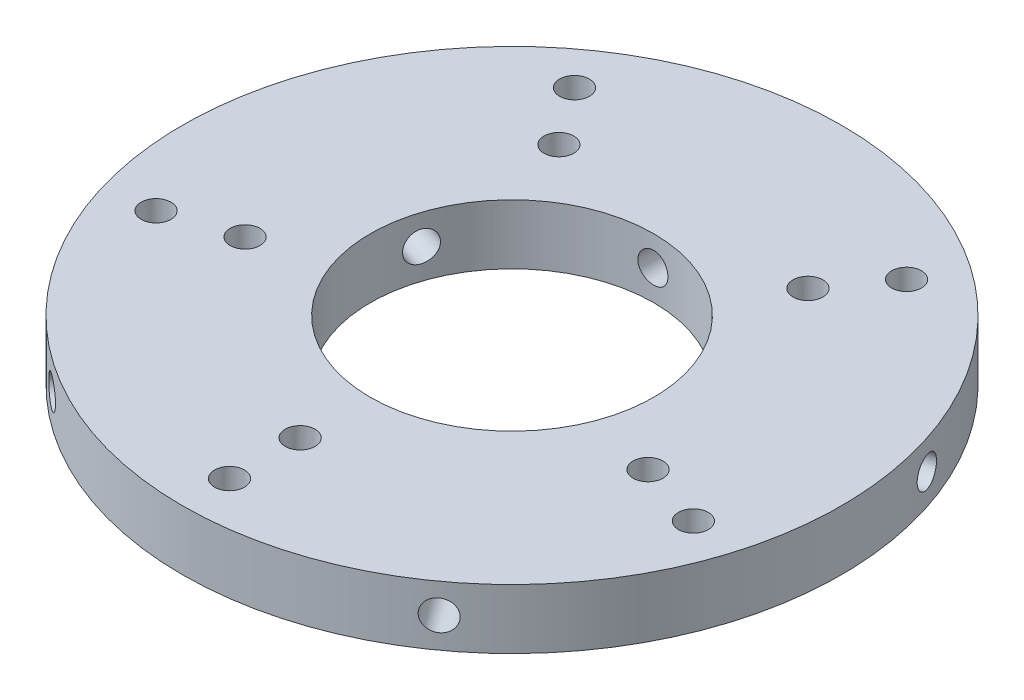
ISO-10303-21;
HEADER;
FILE_DESCRIPTION(('STEP AP214'),'2;1');
FILE_NAME('part.step','',(''),(''),'','','');
FILE_SCHEMA(('AUTOMOTIVE_DESIGN { 1 0 10303 214 1 1 1 1 }'));
ENDSEC;
DATA;
#1=APPLICATION_CONTEXT('core data for automotive mechanical design processes');
#2=APPLICATION_PROTOCOL_DEFINITION('international standard','automotive_design',2000,#1);
#3=PRODUCT_CONTEXT('',#1,'mechanical');
#4=PRODUCT('Part','Part','',(#3));
#5=PRODUCT_RELATED_PRODUCT_CATEGORY('part','',(#4));
#6=PRODUCT_DEFINITION_FORMATION('','',#4);
#7=PRODUCT_DEFINITION_CONTEXT('part definition',#1,'design');
#8=PRODUCT_DEFINITION('design','',#6,#7);
#9=PRODUCT_DEFINITION_SHAPE('','',#8);
#10=(LENGTH_UNIT() NAMED_UNIT(*) SI_UNIT(.MILLI.,.METRE.));
#11=(NAMED_UNIT(*) PLANE_ANGLE_UNIT() SI_UNIT($,.RADIAN.));
#12=(NAMED_UNIT(*) SI_UNIT($,.STERADIAN.) SOLID_ANGLE_UNIT());
#13=UNCERTAINTY_MEASURE_WITH_UNIT(LENGTH_MEASURE(1.E-05),#10,'distance_accuracy_value','');
#14=(GEOMETRIC_REPRESENTATION_CONTEXT(3) GLOBAL_UNCERTAINTY_ASSIGNED_CONTEXT((#13)) GLOBAL_UNIT_ASSIGNED_CONTEXT((#10,
#11,#12)) REPRESENTATION_CONTEXT('',''));
#15=CARTESIAN_POINT('',(0.,0.,0.));
#16=DIRECTION('',(0.,0.,1.));
#17=DIRECTION('',(1.,0.,0.));
#18=AXIS2_PLACEMENT_3D('',#15,#16,#17);
#19=CARTESIAN_POINT('',(0.,12.7,0.));
#20=DIRECTION('',(0.,1.,0.));
#21=DIRECTION('',(0.,0.,1.));
#22=AXIS2_PLACEMENT_3D('',#19,#20,#21);
#23=PLANE('',#22);
#24=CARTESIAN_POINT('',(-42.7975432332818,12.7,13.9057647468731));
#25=DIRECTION('',(0.,1.,0.));
#26=DIRECTION('',(-0.95105651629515,0.,0.309016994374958));
#27=AXIS2_PLACEMENT_3D('',#24,#25,#26);
#28=CIRCLE('',#27,3.175);
#29=CARTESIAN_POINT('',(-45.8171476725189,12.7,14.8868937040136));
#30=VERTEX_POINT('',#29);
#31=EDGE_CURVE('E302',#30,#30,#28,.T.);
#32=ORIENTED_EDGE('',*,*,#31,.F.);
#33=EDGE_LOOP('',(#32));
#34=FACE_BOUND('',#33,.T.);
#35=CARTESIAN_POINT('',(-57.063390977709,12.7,18.5410196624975));
#36=DIRECTION('',(0.,1.,0.));
#37=DIRECTION('',(-0.95105651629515,0.,0.309016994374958));
#38=AXIS2_PLACEMENT_3D('',#35,#36,#37);
#39=CIRCLE('',#38,3.175);
#40=CARTESIAN_POINT('',(-60.0829954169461,12.7,19.522148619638));
#41=VERTEX_POINT('',#40);
#42=EDGE_CURVE('E306',#41,#41,#39,.T.);
#43=ORIENTED_EDGE('',*,*,#42,.F.);
#44=EDGE_LOOP('',(#43));
#45=FACE_BOUND('',#44,.T.);
#46=CARTESIAN_POINT('',(-26.4503363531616,12.7,-36.4057647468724));
#47=DIRECTION('',(0.,1.,0.));
#48=DIRECTION('',(-0.58778525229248,0.,-0.809016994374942));
#49=AXIS2_PLACEMENT_3D('',#46,#47,#48);
#50=CIRCLE('',#49,3.175);
#51=CARTESIAN_POINT('',(-28.3165545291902,12.7,-38.9743937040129));
#52=VERTEX_POINT('',#51);
#53=EDGE_CURVE('E310',#52,#52,#50,.T.);
#54=ORIENTED_EDGE('',*,*,#53,.F.);
#55=EDGE_LOOP('',(#54));
#56=FACE_BOUND('',#55,.T.);
#57=CARTESIAN_POINT('',(-35.2671151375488,12.7,-48.5410196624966));
#58=DIRECTION('',(0.,1.,0.));
#59=DIRECTION('',(-0.58778525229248,0.,-0.809016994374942));
#60=AXIS2_PLACEMENT_3D('',#57,#58,#59);
#61=CIRCLE('',#60,3.175);
#62=CARTESIAN_POINT('',(-37.1333333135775,12.7,-51.109648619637));
#63=VERTEX_POINT('',#62);
#64=EDGE_CURVE('E314',#63,#63,#61,.T.);
#65=ORIENTED_EDGE('',*,*,#64,.F.);
#66=EDGE_LOOP('',(#65));
#67=FACE_BOUND('',#66,.T.);
#68=CARTESIAN_POINT('',(26.4503363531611,12.7,-36.4057647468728));
#69=DIRECTION('',(0.,1.,0.));
#70=DIRECTION('',(0.587785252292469,0.,-0.809016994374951));
#71=AXIS2_PLACEMENT_3D('',#68,#69,#70);
#72=CIRCLE('',#71,3.175);
#73=CARTESIAN_POINT('',(28.3165545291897,12.7,-38.9743937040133));
#74=VERTEX_POINT('',#73);
#75=EDGE_CURVE('E318',#74,#74,#72,.T.);
#76=ORIENTED_EDGE('',*,*,#75,.F.);
#77=EDGE_LOOP('',(#76));
#78=FACE_BOUND('',#77,.T.);
#79=CARTESIAN_POINT('',(35.2671151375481,12.7,-48.5410196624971));
#80=DIRECTION('',(0.,1.,0.));
#81=DIRECTION('',(0.587785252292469,0.,-0.809016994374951));
#82=AXIS2_PLACEMENT_3D('',#79,#80,#81);
#83=CIRCLE('',#82,3.175);
#84=CARTESIAN_POINT('',(37.1333333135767,12.7,-51.1096486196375));
#85=VERTEX_POINT('',#84);
#86=EDGE_CURVE('E322',#85,#85,#83,.T.);
#87=ORIENTED_EDGE('',*,*,#86,.F.);
#88=EDGE_LOOP('',(#87));
#89=FACE_BOUND('',#88,.T.);
#90=CARTESIAN_POINT('',(42.797543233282,12.7,13.9057647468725));
#91=DIRECTION('',(0.,1.,0.));
#92=DIRECTION('',(0.951056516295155,0.,0.309016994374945));
#93=AXIS2_PLACEMENT_3D('',#90,#91,#92);
#94=CIRCLE('',#93,3.175);
#95=CARTESIAN_POINT('',(45.8171476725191,12.7,14.886893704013));
#96=VERTEX_POINT('',#95);
#97=EDGE_CURVE('E326',#96,#96,#94,.T.);
#98=ORIENTED_EDGE('',*,*,#97,.F.);
#99=EDGE_LOOP('',(#98));
#100=FACE_BOUND('',#99,.T.);
#101=CARTESIAN_POINT('',(57.0633909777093,12.7,18.5410196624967));
#102=DIRECTION('',(0.,1.,0.));
#103=DIRECTION('',(0.951056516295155,0.,0.309016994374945));
#104=AXIS2_PLACEMENT_3D('',#101,#102,#103);
#105=CIRCLE('',#104,3.175);
#106=CARTESIAN_POINT('',(60.0829954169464,12.7,19.5221486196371));
#107=VERTEX_POINT('',#106);
#108=EDGE_CURVE('E330',#107,#107,#105,.T.);
#109=ORIENTED_EDGE('',*,*,#108,.F.);
#110=EDGE_LOOP('',(#109));
#111=FACE_BOUND('',#110,.T.);
#112=CARTESIAN_POINT('',(0.,12.7,45.));
#113=DIRECTION('',(0.,1.,0.));
#114=DIRECTION('',(0.,0.,1.));
#115=AXIS2_PLACEMENT_3D('',#112,#113,#114);
#116=CIRCLE('',#115,3.175);
#117=CARTESIAN_POINT('',(0.,12.7,48.175));
#118=VERTEX_POINT('',#117);
#119=EDGE_CURVE('E334',#118,#118,#116,.T.);
#120=ORIENTED_EDGE('',*,*,#119,.F.);
#121=EDGE_LOOP('',(#120));
#122=FACE_BOUND('',#121,.T.);
#123=CARTESIAN_POINT('',(0.,12.7,60.));
#124=DIRECTION('',(0.,1.,0.));
#125=DIRECTION('',(0.,0.,1.));
#126=AXIS2_PLACEMENT_3D('',#123,#124,#125);
#127=CIRCLE('',#126,3.175);
#128=CARTESIAN_POINT('',(0.,12.7,63.175));
#129=VERTEX_POINT('',#128);
#130=EDGE_CURVE('E337',#129,#129,#127,.T.);
#131=ORIENTED_EDGE('',*,*,#130,.F.);
#132=EDGE_LOOP('',(#131));
#133=FACE_BOUND('',#132,.T.);
#134=CARTESIAN_POINT('',(0.,12.7,0.));
#135=DIRECTION('',(0.,1.,0.));
#136=DIRECTION('',(0.,0.,1.));
#137=AXIS2_PLACEMENT_3D('',#134,#135,#136);
#138=CIRCLE('',#137,70.);
#139=CARTESIAN_POINT('',(0.,12.7,70.));
#140=VERTEX_POINT('',#139);
#141=EDGE_CURVE('E10',#140,#140,#138,.T.);
#142=ORIENTED_EDGE('',*,*,#141,.T.);
#143=EDGE_LOOP('',(#142));
#144=FACE_BOUND('',#143,.T.);
#145=CARTESIAN_POINT('',(0.,12.7,0.));
#146=DIRECTION('',(0.,1.,0.));
#147=DIRECTION('',(0.,0.,1.));
#148=AXIS2_PLACEMENT_3D('',#145,#146,#147);
#149=CIRCLE('',#148,30.1);
#150=CARTESIAN_POINT('',(0.,12.7,30.1));
#151=VERTEX_POINT('',#150);
#152=EDGE_CURVE('E35',#151,#151,#149,.T.);
#153=ORIENTED_EDGE('',*,*,#152,.F.);
#154=EDGE_LOOP('',(#153));
#155=FACE_BOUND('',#154,.T.);
#156=ADVANCED_FACE('F24',(#34,#45,#56,#67,#78,#89,#100,#111,#122,#133,#144,#155),#23,.T.);
#157=CARTESIAN_POINT('',(0.,0.,0.));
#158=DIRECTION('',(0.,1.,0.));
#159=DIRECTION('',(0.,0.,1.));
#160=AXIS2_PLACEMENT_3D('',#157,#158,#159);
#161=PLANE('',#160);
#162=CARTESIAN_POINT('',(-42.7975432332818,0.,13.9057647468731));
#163=DIRECTION('',(0.,1.,0.));
#164=DIRECTION('',(0.,0.,1.));
#165=AXIS2_PLACEMENT_3D('',#162,#163,#164);
#166=CIRCLE('',#165,3.175);
#167=CARTESIAN_POINT('',(-42.7975432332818,0.,17.0807647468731));
#168=VERTEX_POINT('',#167);
#169=EDGE_CURVE('E373',#168,#168,#166,.F.);
#170=ORIENTED_EDGE('',*,*,#169,.F.);
#171=EDGE_LOOP('',(#170));
#172=FACE_BOUND('',#171,.T.);
#173=CARTESIAN_POINT('',(-57.063390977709,0.,18.5410196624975));
#174=DIRECTION('',(0.,1.,0.));
#175=DIRECTION('',(0.,0.,1.));
#176=AXIS2_PLACEMENT_3D('',#173,#174,#175);
#177=CIRCLE('',#176,3.175);
#178=CARTESIAN_POINT('',(-57.063390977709,0.,21.7160196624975));
#179=VERTEX_POINT('',#178);
#180=EDGE_CURVE('E369',#179,#179,#177,.F.);
#181=ORIENTED_EDGE('',*,*,#180,.F.);
#182=EDGE_LOOP('',(#181));
#183=FACE_BOUND('',#182,.T.);
#184=CARTESIAN_POINT('',(-26.4503363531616,0.,-36.4057647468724));
#185=DIRECTION('',(0.,1.,0.));
#186=DIRECTION('',(0.,0.,1.));
#187=AXIS2_PLACEMENT_3D('',#184,#185,#186);
#188=CIRCLE('',#187,3.175);
#189=CARTESIAN_POINT('',(-26.4503363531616,0.,-33.2307647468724));
#190=VERTEX_POINT('',#189);
#191=EDGE_CURVE('E365',#190,#190,#188,.F.);
#192=ORIENTED_EDGE('',*,*,#191,.F.);
#193=EDGE_LOOP('',(#192));
#194=FACE_BOUND('',#193,.T.);
#195=CARTESIAN_POINT('',(-35.2671151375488,0.,-48.5410196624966));
#196=DIRECTION('',(0.,1.,0.));
#197=DIRECTION('',(0.,0.,1.));
#198=AXIS2_PLACEMENT_3D('',#195,#196,#197);
#199=CIRCLE('',#198,3.175);
#200=CARTESIAN_POINT('',(-35.2671151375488,0.,-45.3660196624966));
#201=VERTEX_POINT('',#200);
#202=EDGE_CURVE('E361',#201,#201,#199,.F.);
#203=ORIENTED_EDGE('',*,*,#202,.F.);
#204=EDGE_LOOP('',(#203));
#205=FACE_BOUND('',#204,.T.);
#206=CARTESIAN_POINT('',(26.4503363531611,0.,-36.4057647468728));
#207=DIRECTION('',(0.,1.,0.));
#208=DIRECTION('',(0.,0.,1.));
#209=AXIS2_PLACEMENT_3D('',#206,#207,#208);
#210=CIRCLE('',#209,3.175);
#211=CARTESIAN_POINT('',(26.4503363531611,0.,-33.2307647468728));
#212=VERTEX_POINT('',#211);
#213=EDGE_CURVE('E357',#212,#212,#210,.F.);
#214=ORIENTED_EDGE('',*,*,#213,.F.);
#215=EDGE_LOOP('',(#214));
#216=FACE_BOUND('',#215,.T.);
#217=CARTESIAN_POINT('',(35.2671151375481,0.,-48.5410196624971));
#218=DIRECTION('',(0.,1.,0.));
#219=DIRECTION('',(0.,0.,1.));
#220=AXIS2_PLACEMENT_3D('',#217,#218,#219);
#221=CIRCLE('',#220,3.175);
#222=CARTESIAN_POINT('',(35.2671151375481,0.,-45.3660196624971));
#223=VERTEX_POINT('',#222);
#224=EDGE_CURVE('E353',#223,#223,#221,.F.);
#225=ORIENTED_EDGE('',*,*,#224,.F.);
#226=EDGE_LOOP('',(#225));
#227=FACE_BOUND('',#226,.T.);
#228=CARTESIAN_POINT('',(42.797543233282,0.,13.9057647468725));
#229=DIRECTION('',(0.,1.,0.));
#230=DIRECTION('',(0.,0.,1.));
#231=AXIS2_PLACEMENT_3D('',#228,#229,#230);
#232=CIRCLE('',#231,3.175);
#233=CARTESIAN_POINT('',(42.797543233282,0.,17.0807647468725));
#234=VERTEX_POINT('',#233);
#235=EDGE_CURVE('E349',#234,#234,#232,.F.);
#236=ORIENTED_EDGE('',*,*,#235,.F.);
#237=EDGE_LOOP('',(#236));
#238=FACE_BOUND('',#237,.T.);
#239=CARTESIAN_POINT('',(57.0633909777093,0.,18.5410196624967));
#240=DIRECTION('',(0.,1.,0.));
#241=DIRECTION('',(0.,0.,1.));
#242=AXIS2_PLACEMENT_3D('',#239,#240,#241);
#243=CIRCLE('',#242,3.175);
#244=CARTESIAN_POINT('',(57.0633909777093,0.,21.7160196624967));
#245=VERTEX_POINT('',#244);
#246=EDGE_CURVE('E345',#245,#245,#243,.F.);
#247=ORIENTED_EDGE('',*,*,#246,.F.);
#248=EDGE_LOOP('',(#247));
#249=FACE_BOUND('',#248,.T.);
#250=CARTESIAN_POINT('',(0.,0.,45.));
#251=DIRECTION('',(0.,1.,0.));
#252=DIRECTION('',(0.,0.,1.));
#253=AXIS2_PLACEMENT_3D('',#250,#251,#252);
#254=CIRCLE('',#253,3.175);
#255=CARTESIAN_POINT('',(0.,0.,48.175));
#256=VERTEX_POINT('',#255);
#257=EDGE_CURVE('E338',#256,#256,#254,.F.);
#258=ORIENTED_EDGE('',*,*,#257,.F.);
#259=EDGE_LOOP('',(#258));
#260=FACE_BOUND('',#259,.T.);
#261=CARTESIAN_POINT('',(0.,0.,60.));
#262=DIRECTION('',(0.,1.,0.));
#263=DIRECTION('',(0.,0.,1.));
#264=AXIS2_PLACEMENT_3D('',#261,#262,#263);
#265=CIRCLE('',#264,3.175);
#266=CARTESIAN_POINT('',(0.,0.,63.175));
#267=VERTEX_POINT('',#266);
#268=EDGE_CURVE('E134',#267,#267,#265,.F.);
#269=ORIENTED_EDGE('',*,*,#268,.F.);
#270=EDGE_LOOP('',(#269));
#271=FACE_BOUND('',#270,.T.);
#272=CARTESIAN_POINT('',(0.,0.,0.));
#273=DIRECTION('',(0.,1.,0.));
#274=DIRECTION('',(0.,0.,1.));
#275=AXIS2_PLACEMENT_3D('',#272,#273,#274);
#276=CIRCLE('',#275,70.);
#277=CARTESIAN_POINT('',(0.,0.,70.));
#278=VERTEX_POINT('',#277);
#279=EDGE_CURVE('E31',#278,#278,#276,.T.);
#280=ORIENTED_EDGE('',*,*,#279,.F.);
#281=EDGE_LOOP('',(#280));
#282=FACE_BOUND('',#281,.T.);
#283=CARTESIAN_POINT('',(0.,0.,0.));
#284=DIRECTION('',(0.,1.,0.));
#285=DIRECTION('',(0.,0.,1.));
#286=AXIS2_PLACEMENT_3D('',#283,#284,#285);
#287=CIRCLE('',#286,30.1);
#288=CARTESIAN_POINT('',(0.,0.,30.1));
#289=VERTEX_POINT('',#288);
#290=EDGE_CURVE('E39',#289,#289,#287,.T.);
#291=ORIENTED_EDGE('',*,*,#290,.T.);
#292=EDGE_LOOP('',(#291));
#293=FACE_BOUND('',#292,.T.);
#294=ADVANCED_FACE('F192',(#172,#183,#194,#205,#216,#227,#238,#249,#260,#271,#282,#293),#161,.F.);
#295=CARTESIAN_POINT('',(0.,12.7,0.));
#296=DIRECTION('',(0.,-1.,0.));
#297=DIRECTION('',(0.,0.,-1.));
#298=AXIS2_PLACEMENT_3D('',#295,#296,#297);
#299=CYLINDRICAL_SURFACE('',#298,70.);
#300=CARTESIAN_POINT('',(67.4932111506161,6.42883509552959,-18.56519454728));
#301=CARTESIAN_POINT('',(67.4932096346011,6.24919047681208,-18.5652023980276));
#302=CARTESIAN_POINT('',(67.4891862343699,6.06941798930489,-18.5798462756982));
#303=CARTESIAN_POINT('',(67.4731382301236,5.71483095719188,-18.6380388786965));
#304=CARTESIAN_POINT('',(67.4611041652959,5.5400225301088,-18.6816217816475));
#305=CARTESIAN_POINT('',(67.4292165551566,5.20055156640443,-18.7963901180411));
#306=CARTESIAN_POINT('',(67.4093669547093,5.03588395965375,-18.8675616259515));
#307=CARTESIAN_POINT('',(67.362168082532,4.72132295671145,-19.0353847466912));
#308=CARTESIAN_POINT('',(67.3348205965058,4.57142605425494,-19.1320302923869));
#309=CARTESIAN_POINT('',(67.273066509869,4.29048610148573,-19.3480519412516));
#310=CARTESIAN_POINT('',(67.23865457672,4.15945742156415,-19.4674452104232));
#311=CARTESIAN_POINT('',(67.1634231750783,3.92009562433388,-19.7254303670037));
#312=CARTESIAN_POINT('',(67.1226034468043,3.81176342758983,-19.8640230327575));
#313=CARTESIAN_POINT('',(67.0353733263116,3.62083263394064,-20.1564375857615));
#314=CARTESIAN_POINT('',(66.9889605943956,3.53824485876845,-20.3102658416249));
#315=CARTESIAN_POINT('',(66.8916023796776,3.40121683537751,-20.6286503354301));
#316=CARTESIAN_POINT('',(66.8406569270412,3.34677639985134,-20.7932065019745));
#317=CARTESIAN_POINT('',(66.7355254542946,3.26762536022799,-21.1281901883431));
#318=CARTESIAN_POINT('',(66.6813417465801,3.24289380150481,-21.2986134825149));
#319=CARTESIAN_POINT('',(66.5711507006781,3.22379790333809,-21.6405674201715));
#320=CARTESIAN_POINT('',(66.5151433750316,3.22943335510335,-21.8120980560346));
#321=CARTESIAN_POINT('',(66.4029603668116,3.27089407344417,-22.1512696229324));
#322=CARTESIAN_POINT('',(66.346784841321,3.30669677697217,-22.3189133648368));
#323=CARTESIAN_POINT('',(66.2359466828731,3.40744072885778,-22.6457316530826));
#324=CARTESIAN_POINT('',(66.1812840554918,3.47238208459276,-22.804906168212));
#325=CARTESIAN_POINT('',(66.0752236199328,3.62958566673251,-23.1104091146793));
#326=CARTESIAN_POINT('',(66.023827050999,3.72185818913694,-23.2567326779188));
#327=CARTESIAN_POINT('',(65.9260682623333,3.93109728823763,-23.5324234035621));
#328=CARTESIAN_POINT('',(65.8797060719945,4.04806400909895,-23.6617904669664));
#329=CARTESIAN_POINT('',(65.7936170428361,4.30349884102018,-23.9001268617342));
#330=CARTESIAN_POINT('',(65.7538963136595,4.44198652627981,-24.009077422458));
#331=CARTESIAN_POINT('',(65.6825979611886,4.73646330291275,-24.2034517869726));
#332=CARTESIAN_POINT('',(65.6510203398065,4.89245239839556,-24.2888755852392));
#333=CARTESIAN_POINT('',(65.5971970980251,5.2175157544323,-24.4338646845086));
#334=CARTESIAN_POINT('',(65.5749517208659,5.38659035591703,-24.4934293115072));
#335=CARTESIAN_POINT('',(65.5406500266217,5.73302003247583,-24.5850688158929));
#336=CARTESIAN_POINT('',(65.5285936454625,5.91037505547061,-24.6171438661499));
#337=CARTESIAN_POINT('',(65.5151457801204,6.26815921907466,-24.6529115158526));
#338=CARTESIAN_POINT('',(65.5137446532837,6.44858543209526,-24.6566297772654));
#339=CARTESIAN_POINT('',(65.5216366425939,6.80754141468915,-24.6356500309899));
#340=CARTESIAN_POINT('',(65.5309297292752,6.9860711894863,-24.610952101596));
#341=CARTESIAN_POINT('',(65.5598415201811,7.33608970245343,-24.533830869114));
#342=CARTESIAN_POINT('',(65.5794558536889,7.50758138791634,-24.4814193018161));
#343=CARTESIAN_POINT('',(65.628251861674,7.83874642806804,-24.3503064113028));
#344=CARTESIAN_POINT('',(65.657433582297,7.9984197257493,-24.2716049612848));
#345=CARTESIAN_POINT('',(65.724285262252,8.30154148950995,-24.0899908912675));
#346=CARTESIAN_POINT('',(65.761961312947,8.44497820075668,-23.9870608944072));
#347=CARTESIAN_POINT('',(65.844399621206,8.71143695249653,-23.7598317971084));
#348=CARTESIAN_POINT('',(65.8891619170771,8.83445888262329,-23.6355325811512));
#349=CARTESIAN_POINT('',(65.9842081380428,9.05668780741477,-23.3688743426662));
#350=CARTESIAN_POINT('',(66.0344961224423,9.15587712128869,-23.2265020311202));
#351=CARTESIAN_POINT('',(66.1388339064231,9.32750434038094,-22.9277050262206));
#352=CARTESIAN_POINT('',(66.192883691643,9.39994234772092,-22.7712803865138));
#353=CARTESIAN_POINT('',(66.3029433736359,9.51597974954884,-22.448801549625));
#354=CARTESIAN_POINT('',(66.3589524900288,9.55959049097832,-22.2827511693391));
#355=CARTESIAN_POINT('',(66.4712025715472,9.616772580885,-21.945632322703));
#356=CARTESIAN_POINT('',(66.5274435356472,9.63034406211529,-21.7745638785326));
#357=CARTESIAN_POINT('',(66.6384564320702,9.62706107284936,-21.4324157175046));
#358=CARTESIAN_POINT('',(66.6932296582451,9.61023435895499,-21.2613361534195));
#359=CARTESIAN_POINT('',(66.7998674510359,9.54668994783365,-20.9238866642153));
#360=CARTESIAN_POINT('',(66.8517320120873,9.49997219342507,-20.7575167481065));
#361=CARTESIAN_POINT('',(66.951249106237,9.37797727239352,-20.4342572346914));
#362=CARTESIAN_POINT('',(66.9989015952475,9.30269980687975,-20.277367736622));
#363=CARTESIAN_POINT('',(67.0888969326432,9.1257276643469,-19.9775982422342));
#364=CARTESIAN_POINT('',(67.1312399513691,9.02403383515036,-19.8347177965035));
#365=CARTESIAN_POINT('',(67.2097639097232,8.79701822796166,-19.5669913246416));
#366=CARTESIAN_POINT('',(67.2459398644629,8.67167750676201,-19.4421598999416));
#367=CARTESIAN_POINT('',(67.3114066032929,8.40093088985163,-19.2142821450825));
#368=CARTESIAN_POINT('',(67.3406956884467,8.25552005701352,-19.1112411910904));
#369=CARTESIAN_POINT('',(67.3918879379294,7.94866136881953,-18.929932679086));
#370=CARTESIAN_POINT('',(67.4137845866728,7.78719952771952,-18.8516869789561));
#371=CARTESIAN_POINT('',(67.4497835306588,7.45304398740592,-18.7224796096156));
#372=CARTESIAN_POINT('',(67.4638950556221,7.28036386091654,-18.6714856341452));
#373=CARTESIAN_POINT('',(67.480404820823,6.99364434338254,-18.6117032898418));
#374=CARTESIAN_POINT('',(67.4852035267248,6.88146313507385,-18.5942854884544));
#375=CARTESIAN_POINT('',(67.4916071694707,6.65581666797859,-18.5710286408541));
#376=CARTESIAN_POINT('',(67.4932121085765,6.5423514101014,-18.5651895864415));
#377=CARTESIAN_POINT('',(67.4932111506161,6.42883509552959,-18.56519454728));
#378=B_SPLINE_CURVE_WITH_KNOTS('',3,(#300,#301,#302,#303,#304,#305,#306,#307,#308,#309,#310,
#311,#312,#313,#314,#315,#316,#317,#318,#319,#320,#321,#322,#323,#324,#325,#326,#327,#328,#329,
#330,#331,#332,#333,#334,#335,#336,#337,#338,#339,#340,#341,#342,#343,#344,#345,#346,#347,#348,
#349,#350,#351,#352,#353,#354,#355,#356,#357,#358,#359,#360,#361,#362,#363,#364,#365,#366,#367,
#368,#369,#370,#371,#372,#373,#374,#375,#376,#377),.UNSPECIFIED.,.T.,.F.,(4,2,2,2,2,2,2,2,2,2,2,
2,2,2,2,2,2,2,2,2,2,2,2,2,2,2,2,2,2,2,2,2,2,2,2,2,2,2,4),(0.,0.53851948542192,1.07767610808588,
1.61656094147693,2.15531754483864,2.69448232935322,3.23366897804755,3.77308197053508,
4.31249137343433,4.85152008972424,5.39054509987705,5.92916731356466,6.46779151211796,
7.00661887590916,7.54544938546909,8.08477288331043,8.62409650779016,9.16343418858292,
9.70276847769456,10.2416146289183,10.780459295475,11.3190759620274,11.8576952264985,
12.3967019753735,12.9357116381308,13.4751199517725,14.0145262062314,14.5537200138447,
15.0929114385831,15.6316107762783,16.1703111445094,16.7090171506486,17.2477058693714,
17.7868279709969,18.3260829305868,18.8658119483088,19.4048997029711,19.7451870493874,
20.0854741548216),.UNSPECIFIED.);
#379=CARTESIAN_POINT('',(67.4932111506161,6.42883509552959,-18.56519454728));
#380=VERTEX_POINT('',#379);
#381=EDGE_CURVE('E126',#380,#380,#378,.T.);
#382=ORIENTED_EDGE('',*,*,#381,.F.);
#383=EDGE_LOOP('',(#382));
#384=FACE_BOUND('',#383,.T.);
#385=CARTESIAN_POINT('',(38.5130985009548,6.42883509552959,58.4528976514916));
#386=CARTESIAN_POINT('',(38.5131054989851,6.24919047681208,58.4528937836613));
#387=CARTESIAN_POINT('',(38.525789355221,6.06941798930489,58.4445420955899));
#388=CARTESIAN_POINT('',(38.5761747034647,5.71483095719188,58.4112970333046));
#389=CARTESIAN_POINT('',(38.6139057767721,5.5400225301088,58.3863840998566));
#390=CARTESIAN_POINT('',(38.7132031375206,5.20055156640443,58.3205918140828));
#391=CARTESIAN_POINT('',(38.7747574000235,5.03588395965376,58.2797205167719));
#392=CARTESIAN_POINT('',(38.9197814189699,4.72132295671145,58.1829715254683));
#393=CARTESIAN_POINT('',(39.0032459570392,4.57142605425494,58.1270974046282));
#394=CARTESIAN_POINT('',(39.1896116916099,4.29048610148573,58.0016114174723));
#395=CARTESIAN_POINT('',(39.292527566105,4.15945742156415,57.9319891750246));
#396=CARTESIAN_POINT('',(39.5146382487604,3.92009562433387,57.7807180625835));
#397=CARTESIAN_POINT('',(39.6338337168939,3.81176342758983,57.6990687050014));
#398=CARTESIAN_POINT('',(39.8849808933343,3.62083263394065,57.5257468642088));
#399=CARTESIAN_POINT('',(40.016937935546,3.53824485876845,57.4340701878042));
#400=CARTESIAN_POINT('',(40.2896542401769,3.40121683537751,57.2430908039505));
#401=CARTESIAN_POINT('',(40.4304134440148,3.34677639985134,57.1437881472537));
#402=CARTESIAN_POINT('',(40.7165144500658,3.26762536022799,56.940286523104));
#403=CARTESIAN_POINT('',(40.8618529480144,3.24289380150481,56.8360910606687));
#404=CARTESIAN_POINT('',(41.1530195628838,3.22379790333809,56.6256235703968));
#405=CARTESIAN_POINT('',(41.2988476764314,3.22943335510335,56.5193515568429));
#406=CARTESIAN_POINT('',(41.5867525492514,3.27089407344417,56.3078493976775));
#407=CARTESIAN_POINT('',(41.7288320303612,3.30669677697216,56.2026185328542));
#408=CARTESIAN_POINT('',(42.0054038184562,3.40744072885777,55.9962127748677));
#409=CARTESIAN_POINT('',(42.1398960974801,3.47238208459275,55.8950378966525));
#410=CARTESIAN_POINT('',(42.3976721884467,3.6295856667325,55.699762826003));
#411=CARTESIAN_POINT('',(42.5209517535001,3.72185818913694,55.6056653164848));
#412=CARTESIAN_POINT('',(42.752940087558,3.93109728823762,55.4274980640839));
#413=CARTESIAN_POINT('',(42.8616487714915,4.04806400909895,55.3434283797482));
#414=CARTESIAN_POINT('',(43.0617171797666,4.30349884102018,55.1879028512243));
#415=CARTESIAN_POINT('',(43.1530609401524,4.44198652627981,55.1164586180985));
#416=CARTESIAN_POINT('',(43.3158895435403,4.73646330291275,54.9885848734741));
#417=CARTESIAN_POINT('',(43.3873743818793,4.89245239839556,54.9321553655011));
#418=CARTESIAN_POINT('',(43.5086349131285,5.2175157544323,54.8361623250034));
#419=CARTESIAN_POINT('',(43.5584100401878,5.38659035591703,54.7965992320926));
#420=CARTESIAN_POINT('',(43.6349645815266,5.73302003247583,54.7356582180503));
#421=CARTESIAN_POINT('',(43.6617441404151,5.91037505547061,54.7142801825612));
#422=CARTESIAN_POINT('',(43.6916055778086,6.26815921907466,54.6904376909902));
#423=CARTESIAN_POINT('',(43.6947088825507,6.44858543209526,54.6879561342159));
#424=CARTESIAN_POINT('',(43.6771947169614,6.80754141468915,54.7019449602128));
#425=CARTESIAN_POINT('',(43.6565773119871,6.9860711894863,54.7184152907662));
#426=CARTESIAN_POINT('',(43.5921648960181,7.33608970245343,54.769743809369));
#427=CARTESIAN_POINT('',(43.5483796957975,7.50758138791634,54.8045942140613));
#428=CARTESIAN_POINT('',(43.4387627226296,7.83874642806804,54.8915180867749));
#429=CARTESIAN_POINT('',(43.3729308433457,7.9984197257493,54.9435916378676));
#430=CARTESIAN_POINT('',(43.2208639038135,8.30154148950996,55.063293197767));
#431=CARTESIAN_POINT('',(43.1346141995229,8.44497820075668,55.1309323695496));
#432=CARTESIAN_POINT('',(42.9439813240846,8.71143695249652,55.2795535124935));
#433=CARTESIAN_POINT('',(42.8395980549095,8.83445888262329,55.3605355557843));
#434=CARTESIAN_POINT('',(42.6153618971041,9.05668780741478,55.5333318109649));
#435=CARTESIAN_POINT('',(42.4954976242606,9.15587712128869,55.6251539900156));
#436=CARTESIAN_POINT('',(42.2435669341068,9.32750434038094,55.8167184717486));
#437=CARTESIAN_POINT('',(42.1115005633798,9.39994234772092,55.9164607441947));
#438=CARTESIAN_POINT('',(41.8388152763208,9.51597974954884,56.1207851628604));
#439=CARTESIAN_POINT('',(41.6981997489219,9.55959049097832,56.2253653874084));
#440=CARTESIAN_POINT('',(41.4122678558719,9.616772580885,56.4362970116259));
#441=CARTESIAN_POINT('',(41.2669515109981,9.63034406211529,56.5426484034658));
#442=CARTESIAN_POINT('',(40.9758541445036,9.62706107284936,56.7539575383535));
#443=CARTESIAN_POINT('',(40.8300736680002,9.61023435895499,56.8589164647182));
#444=CARTESIAN_POINT('',(40.5420930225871,9.54668994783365,57.0646126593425));
#445=CARTESIAN_POINT('',(40.399892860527,9.49997219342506,57.1653499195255));
#446=CARTESIAN_POINT('',(40.1232072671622,9.37797727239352,57.359888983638));
#447=CARTESIAN_POINT('',(39.9887219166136,9.30269980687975,57.4536907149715));
#448=CARTESIAN_POINT('',(39.7314342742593,9.12572766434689,57.6319152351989));
#449=CARTESIAN_POINT('',(39.6086316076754,9.02403383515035,57.7163383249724));
#450=CARTESIAN_POINT('',(39.3782738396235,8.79701822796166,57.8737510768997));
#451=CARTESIAN_POINT('',(39.2707310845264,8.671677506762,57.9467314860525));
#452=CARTESIAN_POINT('',(39.0742367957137,8.40093088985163,58.0794121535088));
#453=CARTESIAN_POINT('',(38.9852898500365,8.25552005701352,58.1391091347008));
#454=CARTESIAN_POINT('',(38.8286744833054,7.94866136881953,58.2438232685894));
#455=CARTESIAN_POINT('',(38.7610248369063,7.78719952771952,58.2888274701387));
#456=CARTESIAN_POINT('',(38.6492656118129,7.45304398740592,58.3629917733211));
#457=CARTESIAN_POINT('',(38.6051281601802,7.28036386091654,58.3921706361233));
#458=CARTESIAN_POINT('',(38.5533735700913,6.99364434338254,58.4263461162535));
#459=CARTESIAN_POINT('',(38.5382911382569,6.88146313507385,58.4362923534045));
#460=CARTESIAN_POINT('',(38.5181513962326,6.65581666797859,58.4495693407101));
#461=CARTESIAN_POINT('',(38.5130940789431,6.5423514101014,58.4529000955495));
#462=CARTESIAN_POINT('',(38.5130985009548,6.42883509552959,58.4528976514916));
#463=B_SPLINE_CURVE_WITH_KNOTS('',3,(#385,#386,#387,#388,#389,#390,#391,#392,#393,#394,#395,
#396,#397,#398,#399,#400,#401,#402,#403,#404,#405,#406,#407,#408,#409,#410,#411,#412,#413,#414,
#415,#416,#417,#418,#419,#420,#421,#422,#423,#424,#425,#426,#427,#428,#429,#430,#431,#432,#433,
#434,#435,#436,#437,#438,#439,#440,#441,#442,#443,#444,#445,#446,#447,#448,#449,#450,#451,#452,
#453,#454,#455,#456,#457,#458,#459,#460,#461,#462),.UNSPECIFIED.,.T.,.F.,(4,2,2,2,2,2,2,2,2,2,2,
2,2,2,2,2,2,2,2,2,2,2,2,2,2,2,2,2,2,2,2,2,2,2,2,2,2,2,4),(0.,0.538519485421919,1.07767610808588,
1.61656094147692,2.15531754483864,2.69448232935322,3.23366897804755,3.77308197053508,
4.31249137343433,4.85152008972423,5.39054509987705,5.92916731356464,6.46779151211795,
7.00661887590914,7.54544938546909,8.08477288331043,8.62409650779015,9.16343418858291,
9.70276847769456,10.2416146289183,10.780459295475,11.3190759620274,11.8576952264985,
12.3967019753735,12.9357116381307,13.4751199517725,14.0145262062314,14.5537200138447,
15.0929114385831,15.6316107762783,16.1703111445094,16.7090171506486,17.2477058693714,
17.7868279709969,18.3260829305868,18.8658119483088,19.4048997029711,19.7451870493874,
20.0854741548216),.UNSPECIFIED.);
#464=CARTESIAN_POINT('',(38.5130985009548,6.42883509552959,58.4528976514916));
#465=VERTEX_POINT('',#464);
#466=EDGE_CURVE('E92',#465,#465,#463,.T.);
#467=ORIENTED_EDGE('',*,*,#466,.F.);
#468=EDGE_LOOP('',(#467));
#469=FACE_BOUND('',#468,.T.);
#470=CARTESIAN_POINT('',(-43.6908072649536,6.42883509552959,54.6910720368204));
#471=CARTESIAN_POINT('',(-43.6908014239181,6.24919047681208,54.6910774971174));
#472=CARTESIAN_POINT('',(-43.6789389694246,6.06941798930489,54.7005597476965));
#473=CARTESIAN_POINT('',(-43.6317511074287,5.71483095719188,54.7382057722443));
#474=CARTESIAN_POINT('',(-43.596397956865,5.5400225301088,54.766391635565));
#475=CARTESIAN_POINT('',(-43.50314120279,5.20055156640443,54.8404981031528));
#476=CARTESIAN_POINT('',(-43.4452489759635,5.03588395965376,54.8864097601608));
#477=CARTESIAN_POINT('',(-43.3084203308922,4.72132295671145,54.9944387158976));
#478=CARTESIAN_POINT('',(-43.2294889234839,4.57142605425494,55.0565521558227));
#479=CARTESIAN_POINT('',(-43.052554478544,4.29048610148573,55.1950191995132));
#480=CARTESIAN_POINT('',(-42.9545370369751,4.15945742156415,55.2713835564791));
#481=CARTESIAN_POINT('',(-42.742033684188,3.92009562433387,55.4358780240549));
#482=CARTESIAN_POINT('',(-42.6275471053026,3.81176342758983,55.5240086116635));
#483=CARTESIAN_POINT('',(-42.3850994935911,3.62083263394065,55.709304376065));
#484=CARTESIAN_POINT('',(-42.2571328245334,3.53824485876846,55.8064733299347));
#485=CARTESIAN_POINT('',(-41.9912266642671,3.40121683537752,56.0068260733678));
#486=CARTESIAN_POINT('',(-41.8532872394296,3.34677639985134,56.1100098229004));
#487=CARTESIAN_POINT('',(-41.5713356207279,3.26762536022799,56.3192225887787));
#488=CARTESIAN_POINT('',(-41.4273277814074,3.24289380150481,56.4252495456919));
#489=CARTESIAN_POINT('',(-41.1371858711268,3.22379790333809,56.6371274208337));
#490=CARTESIAN_POINT('',(-40.9910518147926,3.22943335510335,56.7429783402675));
#491=CARTESIAN_POINT('',(-40.7009338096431,3.27089407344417,56.951434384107));
#492=CARTESIAN_POINT('',(-40.5569483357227,3.30669677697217,57.0540418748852));
#493=CARTESIAN_POINT('',(-40.2751794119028,3.40744072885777,57.2532943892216));
#494=CARTESIAN_POINT('',(-40.1373959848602,3.47238208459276,57.3499393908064));
#495=CARTESIAN_POINT('',(-39.8720211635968,3.6295856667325,57.5347557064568));
#496=CARTESIAN_POINT('',(-39.7444336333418,3.72185818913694,57.6229238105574));
#497=CARTESIAN_POINT('',(-39.5032981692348,3.93109728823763,57.7885011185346));
#498=CARTESIAN_POINT('',(-39.3897503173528,4.04806400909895,57.865910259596));
#499=CARTESIAN_POINT('',(-39.1800122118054,4.30349884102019,58.0081265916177));
#500=CARTESIAN_POINT('',(-39.0838379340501,4.44198652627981,58.0729221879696));
#501=CARTESIAN_POINT('',(-38.9119059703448,4.73646330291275,58.1882662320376));
#502=CARTESIAN_POINT('',(-38.8361482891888,4.89245239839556,58.2388146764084));
#503=CARTESIAN_POINT('',(-38.7073819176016,5.2175157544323,58.3244768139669));
#504=CARTESIAN_POINT('',(-38.6543738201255,5.38659035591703,58.3595901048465));
#505=CARTESIAN_POINT('',(-38.5727588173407,5.73302003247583,58.4135659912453));
#506=CARTESIAN_POINT('',(-38.5441517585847,5.91037505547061,58.4324286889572));
#507=CARTESIAN_POINT('',(-38.5122485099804,6.26815921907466,58.4534608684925));
#508=CARTESIAN_POINT('',(-38.5089294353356,6.44858543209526,58.4556454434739));
#509=CARTESIAN_POINT('',(-38.5276457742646,6.80754141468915,58.4433112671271));
#510=CARTESIAN_POINT('',(-38.5496811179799,6.9860711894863,58.4287925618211));
#511=CARTESIAN_POINT('',(-38.6184019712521,7.33608970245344,58.3833940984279));
#512=CARTESIAN_POINT('',(-38.6650770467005,7.50758138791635,58.3525212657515));
#513=CARTESIAN_POINT('',(-38.7816200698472,7.83874642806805,58.275130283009));
#514=CARTESIAN_POINT('',(-38.851488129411,7.9984197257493,58.2286120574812));
#515=CARTESIAN_POINT('',(-39.012322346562,8.30154148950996,58.1209776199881));
#516=CARTESIAN_POINT('',(-39.1033036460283,8.44497820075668,58.0598509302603));
#517=CARTESIAN_POINT('',(-39.3035595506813,8.71143695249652,57.9244747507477));
#518=CARTESIAN_POINT('',(-39.4128342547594,8.83445888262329,57.8502251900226));
#519=CARTESIAN_POINT('',(-39.6464660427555,9.05668780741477,57.6903609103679));
#520=CARTESIAN_POINT('',(-39.7708342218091,9.15587712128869,57.6047378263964));
#521=CARTESIAN_POINT('',(-40.0308737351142,9.32750434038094,57.424334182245));
#522=CARTESIAN_POINT('',(-40.1665450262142,9.39994234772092,57.329553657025));
#523=CARTESIAN_POINT('',(-40.4451334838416,9.51597974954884,57.1333542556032));
#524=CARTESIAN_POINT('',(-40.5880477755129,9.55959049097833,57.0319380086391));
#525=CARTESIAN_POINT('',(-40.8770134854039,9.616772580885,56.8251820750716));
#526=CARTESIAN_POINT('',(-41.0230648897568,9.63034406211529,56.7198424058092));
#527=CARTESIAN_POINT('',(-41.313985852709,9.62706107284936,56.5082904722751));
#528=CARTESIAN_POINT('',(-41.4588563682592,9.61023435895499,56.4020790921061));
#529=CARTESIAN_POINT('',(-41.7434759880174,9.54668994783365,56.1917568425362));
#530=CARTESIAN_POINT('',(-41.8832250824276,9.49997219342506,56.0876459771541));
#531=CARTESIAN_POINT('',(-42.1537432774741,9.37797727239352,55.8846182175));
#532=CARTESIAN_POINT('',(-42.2845122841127,9.30269980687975,55.7857013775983));
#533=CARTESIAN_POINT('',(-42.5335201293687,9.1257276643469,55.5960806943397));
#534=CARTESIAN_POINT('',(-42.6517593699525,9.02403383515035,55.5053765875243));
#535=CARTESIAN_POINT('',(-42.8726522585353,8.79701822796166,55.3349365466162));
#536=CARTESIAN_POINT('',(-42.9752932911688,8.671677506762,55.2552094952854));
#537=CARTESIAN_POINT('',(-43.1622001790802,8.40093088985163,55.1093329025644));
#538=CARTESIAN_POINT('',(-43.246461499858,8.25552005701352,55.0431867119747));
#539=CARTESIAN_POINT('',(-43.3944473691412,7.94866136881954,54.9265950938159));
#540=CARTESIAN_POINT('',(-43.458153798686,7.78719952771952,54.87616351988));
#541=CARTESIAN_POINT('',(-43.5632237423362,7.45304398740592,54.7927922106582));
#542=CARTESIAN_POINT('',(-43.6046137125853,7.28036386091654,54.7598317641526));
#543=CARTESIAN_POINT('',(-43.6531095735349,6.99364434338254,54.7211710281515));
#544=CARTESIAN_POINT('',(-43.6672297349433,6.88146313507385,54.7099003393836));
#545=CARTESIAN_POINT('',(-43.686080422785,6.65581666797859,54.6948491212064));
#546=CARTESIAN_POINT('',(-43.6908109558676,6.5423514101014,54.6910685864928));
#547=CARTESIAN_POINT('',(-43.6908072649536,6.42883509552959,54.6910720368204));
#548=B_SPLINE_CURVE_WITH_KNOTS('',3,(#470,#471,#472,#473,#474,#475,#476,#477,#478,#479,#480,
#481,#482,#483,#484,#485,#486,#487,#488,#489,#490,#491,#492,#493,#494,#495,#496,#497,#498,#499,
#500,#501,#502,#503,#504,#505,#506,#507,#508,#509,#510,#511,#512,#513,#514,#515,#516,#517,#518,
#519,#520,#521,#522,#523,#524,#525,#526,#527,#528,#529,#530,#531,#532,#533,#534,#535,#536,#537,
#538,#539,#540,#541,#542,#543,#544,#545,#546,#547),.UNSPECIFIED.,.T.,.F.,(4,2,2,2,2,2,2,2,2,2,2,
2,2,2,2,2,2,2,2,2,2,2,2,2,2,2,2,2,2,2,2,2,2,2,2,2,2,2,4),(0.,0.538519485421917,1.07767610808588,
1.61656094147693,2.15531754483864,2.69448232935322,3.23366897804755,3.77308197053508,
4.31249137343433,4.85152008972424,5.39054509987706,5.92916731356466,6.46779151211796,
7.00661887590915,7.54544938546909,8.08477288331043,8.62409650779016,9.16343418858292,
9.70276847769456,10.2416146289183,10.780459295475,11.3190759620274,11.8576952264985,
12.3967019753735,12.9357116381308,13.4751199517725,14.0145262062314,14.5537200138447,
15.0929114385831,15.6316107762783,16.1703111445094,16.7090171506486,17.2477058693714,
17.7868279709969,18.3260829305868,18.8658119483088,19.4048997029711,19.7451870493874,
20.0854741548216),.UNSPECIFIED.);
#549=CARTESIAN_POINT('',(-43.6908072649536,6.42883509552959,54.6910720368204));
#550=VERTEX_POINT('',#549);
#551=EDGE_CURVE('E84',#550,#550,#548,.T.);
#552=ORIENTED_EDGE('',*,*,#551,.F.);
#553=EDGE_LOOP('',(#552));
#554=FACE_BOUND('',#553,.T.);
#555=CARTESIAN_POINT('',(-65.5155023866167,6.42883509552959,-24.651956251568));
#556=CARTESIAN_POINT('',(-65.5155057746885,6.24919047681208,-24.6519490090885));
#557=CARTESIAN_POINT('',(-65.5208582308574,6.06941798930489,-24.6377369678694));
#558=CARTESIAN_POINT('',(-65.5420798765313,5.71483095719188,-24.5812253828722));
#559=CARTESIAN_POINT('',(-65.5579615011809,5.5400225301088,-24.5388926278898));
#560=CARTESIAN_POINT('',(-65.5996230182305,5.20055156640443,-24.4273000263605));
#561=CARTESIAN_POINT('',(-65.6253979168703,5.03588395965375,-24.3580537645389));
#562=CARTESIAN_POINT('',(-65.685857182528,4.72132295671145,-24.1945392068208));
#563=CARTESIAN_POINT('',(-65.7205394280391,4.57142605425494,-24.1002768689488));
#564=CARTESIAN_POINT('',(-65.7975536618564,4.29048610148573,-23.8892135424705));
#565=CARTESIAN_POINT('',(-65.8398914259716,4.15945742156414,-23.7723955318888));
#566=CARTESIAN_POINT('',(-65.9306678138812,3.92009562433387,-23.5194612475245));
#567=CARTESIAN_POINT('',(-65.9791066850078,3.81176342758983,-23.3833441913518));
#568=CARTESIAN_POINT('',(-66.0804129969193,3.62083263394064,-23.0955032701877));
#569=CARTESIAN_POINT('',(-66.1332822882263,3.53824485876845,-22.9437728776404));
#570=CARTESIAN_POINT('',(-66.2416595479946,3.40121683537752,-22.6289686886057));
#571=CARTESIAN_POINT('',(-66.2971674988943,3.34677639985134,-22.4658949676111));
#572=CARTESIAN_POINT('',(-66.4090128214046,3.26762536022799,-22.1330927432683));
#573=CARTESIAN_POINT('',(-66.4653495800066,3.24289380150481,-21.9633690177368));
#574=CARTESIAN_POINT('',(-66.5771986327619,3.22379790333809,-21.6219537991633));
#575=CARTESIAN_POINT('',(-66.632710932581,3.22943335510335,-21.4502623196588));
#576=CARTESIAN_POINT('',(-66.7413130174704,3.27089407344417,-21.1099272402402));
#577=CARTESIAN_POINT('',(-66.7944045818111,3.30669677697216,-20.9412814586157));
#578=CARTESIAN_POINT('',(-66.8968335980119,3.40744072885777,-20.6117308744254));
#579=CARTESIAN_POINT('',(-66.9461710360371,3.47238208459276,-20.450826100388));
#580=CARTESIAN_POINT('',(-67.0399364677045,3.6295856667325,-20.1413282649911));
#581=CARTESIAN_POINT('',(-67.0843626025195,3.72185818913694,-19.9927398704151));
#582=CARTESIAN_POINT('',(-67.1673210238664,3.93109728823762,-19.7122402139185));
#583=CARTESIAN_POINT('',(-67.2058532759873,4.04806400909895,-19.5803290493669));
#584=CARTESIAN_POINT('',(-67.276296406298,4.30349884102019,-19.3369089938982));
#585=CARTESIAN_POINT('',(-67.3082011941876,4.44198652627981,-19.2254188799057));
#586=CARTESIAN_POINT('',(-67.3647700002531,4.73646330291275,-19.0262585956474));
#587=CARTESIAN_POINT('',(-67.3894340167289,4.89245239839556,-18.9385884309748));
#588=CARTESIAN_POINT('',(-67.4311125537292,5.2175157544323,-18.789653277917));
#589=CARTESIAN_POINT('',(-67.4481268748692,5.38659035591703,-18.7283889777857));
#590=CARTESIAN_POINT('',(-67.4742405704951,5.73302003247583,-18.6340890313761));
#591=CARTESIAN_POINT('',(-67.4833399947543,5.91037505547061,-18.6010532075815));
#592=CARTESIAN_POINT('',(-67.4934841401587,6.26815921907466,-18.5642121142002));
#593=CARTESIAN_POINT('',(-67.4945361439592,6.44858543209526,-18.5603804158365));
#594=CARTESIAN_POINT('',(-67.488589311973,6.80754141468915,-18.5819921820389));
#595=CARTESIAN_POINT('',(-67.4815904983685,6.9860711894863,-18.607435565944));
#596=CARTESIAN_POINT('',(-67.4596499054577,7.33608970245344,-18.6868218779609));
#597=CARTESIAN_POINT('',(-67.4447114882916,7.50758138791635,-18.7407527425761));
#598=CARTESIAN_POINT('',(-67.40712206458,7.83874642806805,-18.8755068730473));
#599=CARTESIAN_POINT('',(-67.3844710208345,7.9984197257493,-18.9563302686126));
#600=CARTESIAN_POINT('',(-67.3318050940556,8.30154148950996,-19.1425535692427));
#601=CARTESIAN_POINT('',(-67.3017849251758,8.44497820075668,-19.2479711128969));
#602=CARTESIAN_POINT('',(-67.2349170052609,8.71143695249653,-19.4802593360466));
#603=CARTESIAN_POINT('',(-67.1980692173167,8.8344588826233,-19.6071301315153));
#604=CARTESIAN_POINT('',(-67.1182254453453,9.05668780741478,-19.8787279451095));
#605=CARTESIAN_POINT('',(-67.0752249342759,9.15587712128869,-20.0234681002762));
#606=CARTESIAN_POINT('',(-66.9840075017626,9.32750434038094,-20.3265281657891));
#607=CARTESIAN_POINT('',(-66.9357906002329,9.39994234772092,-20.4848480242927));
#608=CARTESIAN_POINT('',(-66.8352824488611,9.51597974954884,-20.8104303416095));
#609=CARTESIAN_POINT('',(-66.7829928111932,9.55959049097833,-20.9776892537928));
#610=CARTESIAN_POINT('',(-66.675651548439,9.616772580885,-21.3164030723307));
#611=CARTESIAN_POINT('',(-66.62059993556,9.63034406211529,-21.4878579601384));
#612=CARTESIAN_POINT('',(-66.5093016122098,9.62706107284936,-21.829913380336));
#613=CARTESIAN_POINT('',(-66.4530560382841,9.61023435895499,-22.0005145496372));
#614=CARTESIAN_POINT('',(-66.3409799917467,9.54668994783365,-22.3361970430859));
#615=CARTESIAN_POINT('',(-66.2851495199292,9.49997219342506,-22.5012783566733));
#616=CARTESIAN_POINT('',(-66.1756533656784,9.37797727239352,-22.8212954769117));
#617=CARTESIAN_POINT('',(-66.1219877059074,9.30269980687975,-22.9762311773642));
#618=CARTESIAN_POINT('',(-66.0185953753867,9.1257276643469,-23.2716477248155));
#619=CARTESIAN_POINT('',(-65.9688685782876,9.02403383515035,-23.4121290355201));
#620=CARTESIAN_POINT('',(-65.875030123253,8.79701822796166,-23.6748795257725));
#621=CARTESIAN_POINT('',(-65.8309230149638,8.67167750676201,-23.7971339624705));
#622=CARTESIAN_POINT('',(-65.7499435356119,8.40093088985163,-24.0199713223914));
#623=CARTESIAN_POINT('',(-65.7130729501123,8.25552005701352,-24.1205488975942));
#624=CARTESIAN_POINT('',(-65.6479178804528,7.94866136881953,-24.2973206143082));
#625=CARTESIAN_POINT('',(-65.6196409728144,7.78719952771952,-24.3734932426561));
#626=CARTESIAN_POINT('',(-65.5728185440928,7.45304398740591,-24.4991838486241));
#627=CARTESIAN_POINT('',(-65.5542615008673,7.28036386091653,-24.5487333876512));
#628=CARTESIAN_POINT('',(-65.532479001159,6.99364434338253,-24.6068025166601));
#629=CARTESIAN_POINT('',(-65.5261233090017,6.88146313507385,-24.6237144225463));
#630=CARTESIAN_POINT('',(-65.5176339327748,6.65581666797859,-24.6462935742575));
#631=CARTESIAN_POINT('',(-65.5155002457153,6.5423514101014,-24.6519608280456));
#632=CARTESIAN_POINT('',(-65.5155023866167,6.42883509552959,-24.651956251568));
#633=B_SPLINE_CURVE_WITH_KNOTS('',3,(#555,#556,#557,#558,#559,#560,#561,#562,#563,#564,#565,
#566,#567,#568,#569,#570,#571,#572,#573,#574,#575,#576,#577,#578,#579,#580,#581,#582,#583,#584,
#585,#586,#587,#588,#589,#590,#591,#592,#593,#594,#595,#596,#597,#598,#599,#600,#601,#602,#603,
#604,#605,#606,#607,#608,#609,#610,#611,#612,#613,#614,#615,#616,#617,#618,#619,#620,#621,#622,
#623,#624,#625,#626,#627,#628,#629,#630,#631,#632),.UNSPECIFIED.,.T.,.F.,(4,2,2,2,2,2,2,2,2,2,2,
2,2,2,2,2,2,2,2,2,2,2,2,2,2,2,2,2,2,2,2,2,2,2,2,2,2,2,4),(0.,0.538519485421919,1.07767610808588,
1.61656094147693,2.15531754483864,2.69448232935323,3.23366897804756,3.77308197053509,
4.31249137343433,4.85152008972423,5.39054509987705,5.92916731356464,6.46779151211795,
7.00661887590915,7.54544938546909,8.08477288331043,8.62409650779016,9.16343418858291,
9.70276847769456,10.2416146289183,10.780459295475,11.3190759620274,11.8576952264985,
12.3967019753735,12.9357116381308,13.4751199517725,14.0145262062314,14.5537200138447,
15.0929114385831,15.6316107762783,16.1703111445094,16.7090171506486,17.2477058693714,
17.7868279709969,18.3260829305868,18.8658119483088,19.4048997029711,19.7451870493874,
20.0854741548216),.UNSPECIFIED.);
#634=CARTESIAN_POINT('',(-65.5155023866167,6.42883509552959,-24.651956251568));
#635=VERTEX_POINT('',#634);
#636=EDGE_CURVE('E76',#635,#635,#633,.T.);
#637=ORIENTED_EDGE('',*,*,#636,.F.);
#638=EDGE_LOOP('',(#637));
#639=FACE_BOUND('',#638,.T.);
#640=CARTESIAN_POINT('',(3.2,6.42883509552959,-69.9268188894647));
#641=CARTESIAN_POINT('',(3.19999206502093,6.24919047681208,-69.9268198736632));
#642=CARTESIAN_POINT('',(3.18482161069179,6.06941798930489,-69.9275185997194));
#643=CARTESIAN_POINT('',(3.12451805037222,5.71483095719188,-69.9302385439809));
#644=CARTESIAN_POINT('',(3.07934951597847,5.5400225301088,-69.932261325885));
#645=CARTESIAN_POINT('',(2.96034452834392,5.20055156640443,-69.9373997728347));
#646=CARTESIAN_POINT('',(2.88652253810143,5.03588395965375,-69.9405148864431));
#647=CARTESIAN_POINT('',(2.71232801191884,4.72132295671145,-69.9474862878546));
#648=CARTESIAN_POINT('',(2.61196179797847,4.57142605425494,-69.9513423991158));
#649=CARTESIAN_POINT('',(2.387429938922,4.29048610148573,-69.9593651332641));
#650=CARTESIAN_POINT('',(2.26324632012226,4.15945742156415,-69.9635319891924));
#651=CARTESIAN_POINT('',(1.99464007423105,3.92009562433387,-69.9717044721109));
#652=CARTESIAN_POINT('',(1.85021662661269,3.81176342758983,-69.9757100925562));
#653=CARTESIAN_POINT('',(1.54515827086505,3.62083263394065,-69.9831103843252));
#654=CARTESIAN_POINT('',(1.38451658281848,3.53824485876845,-69.9865047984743));
#655=CARTESIAN_POINT('',(1.05162959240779,3.40121683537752,-69.9922978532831));
#656=CARTESIAN_POINT('',(0.879384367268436,3.34677639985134,-69.9946965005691));
#657=CARTESIAN_POINT('',(0.528308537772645,3.26762536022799,-69.998226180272));
#658=CARTESIAN_POINT('',(0.349482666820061,3.24289380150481,-69.9993581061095));
#659=CARTESIAN_POINT('',(-0.00978575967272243,3.22379790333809,-70.0002297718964));
#660=CARTESIAN_POINT('',(-0.190228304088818,3.22943335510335,-69.9999695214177));
#661=CARTESIAN_POINT('',(-0.547466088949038,3.27089407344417,-69.9980869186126));
#662=CARTESIAN_POINT('',(-0.724263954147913,3.30669677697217,-69.9964655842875));
#663=CARTESIAN_POINT('',(-1.06933749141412,3.40744072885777,-69.992044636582));
#664=CARTESIAN_POINT('',(-1.23761313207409,3.47238208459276,-69.9892450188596));
#665=CARTESIAN_POINT('',(-1.56093817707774,3.6295856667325,-69.9827811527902));
#666=CARTESIAN_POINT('',(-1.7159825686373,3.72185818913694,-69.979116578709));
#667=CARTESIAN_POINT('',(-2.00838915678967,3.93109728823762,-69.9713355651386));
#668=CARTESIAN_POINT('',(-2.14575125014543,4.04806400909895,-69.9672191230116));
#669=CARTESIAN_POINT('',(-2.39902560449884,4.30349884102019,-69.9589935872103));
#670=CARTESIAN_POINT('',(-2.51491812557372,4.44198652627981,-69.9548845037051));
#671=CARTESIAN_POINT('',(-2.72181153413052,4.73646330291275,-69.9471407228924));
#672=CARTESIAN_POINT('',(-2.81281241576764,4.89245239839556,-69.9435060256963));
#673=CARTESIAN_POINT('',(-2.96733753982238,5.2175157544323,-69.9371211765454));
#674=CARTESIAN_POINT('',(-3.03086106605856,5.38659035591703,-69.9343710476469));
#675=CARTESIAN_POINT('',(-3.12861522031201,5.73302003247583,-69.9300663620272));
#676=CARTESIAN_POINT('',(-3.16284603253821,5.91037505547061,-69.9285117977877));
#677=CARTESIAN_POINT('',(-3.20101870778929,6.26815921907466,-69.9267749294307));
#678=CARTESIAN_POINT('',(-3.20498795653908,6.44858543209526,-69.9265913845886));
#679=CARTESIAN_POINT('',(-3.18259627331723,6.80754141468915,-69.9276140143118));
#680=CARTESIAN_POINT('',(-3.15623542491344,6.9860711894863,-69.9288201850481));
#681=CARTESIAN_POINT('',(-3.07395453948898,7.33608970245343,-69.9324851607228));
#682=CARTESIAN_POINT('',(-3.01804701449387,7.50758138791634,-69.9349434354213));
#683=CARTESIAN_POINT('',(-2.87827244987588,7.83874642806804,-69.9408350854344));
#684=CARTESIAN_POINT('',(-2.79440527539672,7.9984197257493,-69.9442684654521));
#685=CARTESIAN_POINT('',(-2.6010217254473,8.30154148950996,-69.9517263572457));
#686=CARTESIAN_POINT('',(-2.49148694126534,8.44497820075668,-69.9557512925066));
#687=CARTESIAN_POINT('',(-2.24990438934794,8.71143695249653,-69.9639371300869));
#688=CARTESIAN_POINT('',(-2.11785649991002,8.8344588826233,-69.9680980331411));
#689=CARTESIAN_POINT('',(-1.83487854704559,9.05668780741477,-69.9760904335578));
#690=CARTESIAN_POINT('',(-1.68393459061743,9.15587712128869,-69.9799216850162));
#691=CARTESIAN_POINT('',(-1.36751960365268,9.32750434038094,-69.9868194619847));
#692=CARTESIAN_POINT('',(-1.20204862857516,9.39994234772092,-69.989885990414));
#693=CARTESIAN_POINT('',(-0.861342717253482,9.51597974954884,-69.9949075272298));
#694=CARTESIAN_POINT('',(-0.68611165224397,9.55959049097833,-69.9968629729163));
#695=CARTESIAN_POINT('',(-0.330805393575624,9.616772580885,-69.9994436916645));
#696=CARTESIAN_POINT('',(-0.150730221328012,9.63034406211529,-70.0000689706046));
#697=CARTESIAN_POINT('',(0.208976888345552,9.62706107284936,-69.9999189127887));
#698=CARTESIAN_POINT('',(0.388609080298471,9.61023435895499,-69.9991448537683));
#699=CARTESIAN_POINT('',(0.742495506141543,9.54668994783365,-69.9962857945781));
#700=CARTESIAN_POINT('',(0.916749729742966,9.49997219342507,-69.9942007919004));
#701=CARTESIAN_POINT('',(1.25494026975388,9.37797727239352,-69.9889544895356));
#702=CARTESIAN_POINT('',(1.41887647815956,9.30269980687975,-69.9857931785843));
#703=CARTESIAN_POINT('',(1.73178429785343,9.1257276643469,-69.9787499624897));
#704=CARTESIAN_POINT('',(1.88075638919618,9.02403383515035,-69.9748680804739));
#705=CARTESIAN_POINT('',(2.1596446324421,8.79701822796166,-69.9668167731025));
#706=CARTESIAN_POINT('',(2.28954535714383,8.67167750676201,-69.9626471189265));
#707=CARTESIAN_POINT('',(2.526500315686,8.40093088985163,-69.9544915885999));
#708=CARTESIAN_POINT('',(2.63354891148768,8.25552005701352,-69.9505057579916));
#709=CARTESIAN_POINT('',(2.82180282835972,7.94866136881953,-69.9431650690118));
#710=CARTESIAN_POINT('',(2.9029853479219,7.78719952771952,-69.9398107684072));
#711=CARTESIAN_POINT('',(3.03699314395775,7.45304398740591,-69.9341205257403));
#712=CARTESIAN_POINT('',(3.08985199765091,7.28036386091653,-69.9317833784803));
#713=CARTESIAN_POINT('',(3.15181018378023,6.99364434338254,-69.9290113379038));
#714=CARTESIAN_POINT('',(3.16985837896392,6.88146313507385,-69.9281927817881));
#715=CARTESIAN_POINT('',(3.19395578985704,6.65581666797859,-69.9270962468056));
#716=CARTESIAN_POINT('',(3.2000050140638,6.5423514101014,-69.9268182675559));
#717=CARTESIAN_POINT('',(3.2,6.42883509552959,-69.9268188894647));
#718=B_SPLINE_CURVE_WITH_KNOTS('',3,(#640,#641,#642,#643,#644,#645,#646,#647,#648,#649,#650,
#651,#652,#653,#654,#655,#656,#657,#658,#659,#660,#661,#662,#663,#664,#665,#666,#667,#668,#669,
#670,#671,#672,#673,#674,#675,#676,#677,#678,#679,#680,#681,#682,#683,#684,#685,#686,#687,#688,
#689,#690,#691,#692,#693,#694,#695,#696,#697,#698,#699,#700,#701,#702,#703,#704,#705,#706,#707,
#708,#709,#710,#711,#712,#713,#714,#715,#716,#717),.UNSPECIFIED.,.T.,.F.,(4,2,2,2,2,2,2,2,2,2,2,
2,2,2,2,2,2,2,2,2,2,2,2,2,2,2,2,2,2,2,2,2,2,2,2,2,2,2,4),(0.,0.538519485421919,1.07767610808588,
1.61656094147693,2.15531754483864,2.69448232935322,3.23366897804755,3.77308197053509,
4.31249137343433,4.85152008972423,5.39054509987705,5.92916731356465,6.46779151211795,
7.00661887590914,7.54544938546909,8.08477288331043,8.62409650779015,9.16343418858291,
9.70276847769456,10.2416146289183,10.780459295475,11.3190759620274,11.8576952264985,
12.3967019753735,12.9357116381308,13.4751199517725,14.0145262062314,14.5537200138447,
15.0929114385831,15.6316107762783,16.1703111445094,16.7090171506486,17.2477058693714,
17.7868279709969,18.3260829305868,18.8658119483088,19.4048997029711,19.7451870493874,
20.0854741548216),.UNSPECIFIED.);
#719=CARTESIAN_POINT('',(3.2,6.42883509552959,-69.9268188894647));
#720=VERTEX_POINT('',#719);
#721=EDGE_CURVE('E44',#720,#720,#718,.T.);
#722=ORIENTED_EDGE('',*,*,#721,.F.);
#723=EDGE_LOOP('',(#722));
#724=FACE_BOUND('',#723,.T.);
#725=ORIENTED_EDGE('',*,*,#141,.F.);
#726=EDGE_LOOP('',(#725));
#727=FACE_BOUND('',#726,.T.);
#728=ORIENTED_EDGE('',*,*,#279,.T.);
#729=EDGE_LOOP('',(#728));
#730=FACE_BOUND('',#729,.T.);
#731=ADVANCED_FACE('F26',(#384,#469,#554,#639,#724,#727,#730),#299,.T.);
#732=CARTESIAN_POINT('',(0.,12.7,0.));
#733=DIRECTION('',(0.,-1.,0.));
#734=DIRECTION('',(0.,0.,-1.));
#735=AXIS2_PLACEMENT_3D('',#732,#733,#734);
#736=CYLINDRICAL_SURFACE('',#735,30.1);
#737=CARTESIAN_POINT('',(29.4534214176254,6.42883509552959,-6.20531762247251));
#738=CARTESIAN_POINT('',(29.4534211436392,6.24963546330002,-6.20532566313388));
#739=CARTESIAN_POINT('',(29.4503013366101,6.07031884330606,-6.22018456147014));
#740=CARTESIAN_POINT('',(29.4377755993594,5.71666156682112,-6.2791912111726));
#741=CARTESIAN_POINT('',(29.4283628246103,5.54232654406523,-6.32337085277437));
#742=CARTESIAN_POINT('',(29.4031492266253,5.20380490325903,-6.43959078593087));
#743=CARTESIAN_POINT('',(29.3873523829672,5.03961203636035,-6.51161371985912));
#744=CARTESIAN_POINT('',(29.3492482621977,4.72590700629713,-6.68125346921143));
#745=CARTESIAN_POINT('',(29.3269422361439,4.57639202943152,-6.77886536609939));
#746=CARTESIAN_POINT('',(29.2756392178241,4.2956410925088,-6.99710816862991));
#747=CARTESIAN_POINT('',(29.2466181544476,4.1644736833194,-7.117821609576));
#748=CARTESIAN_POINT('',(29.1819655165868,3.92473199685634,-7.37840583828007));
#749=CARTESIAN_POINT('',(29.146333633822,3.81615877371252,-7.51827751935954));
#750=CARTESIAN_POINT('',(29.0686166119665,3.62444806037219,-7.81337496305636));
#751=CARTESIAN_POINT('',(29.0265163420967,3.54137161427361,-7.96863641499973));
#752=CARTESIAN_POINT('',(28.936476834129,3.40340331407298,-8.2896360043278));
#753=CARTESIAN_POINT('',(28.8885377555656,3.34851069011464,-8.45537385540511));
#754=CARTESIAN_POINT('',(28.7879280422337,3.26867031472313,-8.79180833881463));
#755=CARTESIAN_POINT('',(28.73527607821,3.24360957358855,-8.96248373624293));
#756=CARTESIAN_POINT('',(28.6263781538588,3.22379460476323,-9.30444331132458));
#757=CARTESIAN_POINT('',(28.5701322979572,3.22903949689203,-9.47572747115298));
#758=CARTESIAN_POINT('',(28.4559341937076,3.26959546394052,-9.81333007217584));
#759=CARTESIAN_POINT('',(28.3979897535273,3.30478503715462,-9.97966577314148));
#760=CARTESIAN_POINT('',(28.2821099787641,3.4040420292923,-10.3034871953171));
#761=CARTESIAN_POINT('',(28.2241746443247,3.46810986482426,-10.4609727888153));
#762=CARTESIAN_POINT('',(28.1103330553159,3.62343701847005,-10.7631465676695));
#763=CARTESIAN_POINT('',(28.0544310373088,3.71474982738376,-10.9078088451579));
#764=CARTESIAN_POINT('',(27.947004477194,3.92193603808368,-11.1801793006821));
#765=CARTESIAN_POINT('',(27.8954800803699,4.03781025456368,-11.3078869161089));
#766=CARTESIAN_POINT('',(27.7987582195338,4.29151272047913,-11.5436299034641));
#767=CARTESIAN_POINT('',(27.7535933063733,4.42944671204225,-11.651564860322));
#768=CARTESIAN_POINT('',(27.6719398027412,4.7229874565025,-11.8441853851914));
#769=CARTESIAN_POINT('',(27.6354512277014,4.87859424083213,-11.928870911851));
#770=CARTESIAN_POINT('',(27.5728738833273,5.20314757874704,-12.0728131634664));
#771=CARTESIAN_POINT('',(27.5467877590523,5.37209751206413,-12.1320634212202));
#772=CARTESIAN_POINT('',(27.5063168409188,5.71849916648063,-12.2235452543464));
#773=CARTESIAN_POINT('',(27.4919316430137,5.89595059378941,-12.2557777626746));
#774=CARTESIAN_POINT('',(27.4756294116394,6.25339005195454,-12.2922818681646));
#775=CARTESIAN_POINT('',(27.4736518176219,6.43336145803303,-12.2966892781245));
#776=CARTESIAN_POINT('',(27.4821034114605,6.7915464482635,-12.2777886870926));
#777=CARTESIAN_POINT('',(27.4925324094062,6.96976005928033,-12.2544811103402));
#778=CARTESIAN_POINT('',(27.5252315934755,7.3189367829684,-12.1808548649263));
#779=CARTESIAN_POINT('',(27.5474734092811,7.48991621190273,-12.1306009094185));
#780=CARTESIAN_POINT('',(27.6026884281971,7.82027902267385,-12.004428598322));
#781=CARTESIAN_POINT('',(27.6356619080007,7.97966210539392,-11.9285095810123));
#782=CARTESIAN_POINT('',(27.7109209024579,8.28298081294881,-11.7526173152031));
#783=CARTESIAN_POINT('',(27.7532417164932,8.42685471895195,-11.652552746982));
#784=CARTESIAN_POINT('',(27.8451866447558,8.69444425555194,-11.4310943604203));
#785=CARTESIAN_POINT('',(27.8948109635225,8.81815932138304,-11.3096999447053));
#786=CARTESIAN_POINT('',(27.999421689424,9.04243153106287,-11.0481791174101));
#787=CARTESIAN_POINT('',(28.0544291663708,9.142892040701,-10.9079782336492));
#788=CARTESIAN_POINT('',(28.1673649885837,9.31713761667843,-10.6129386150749));
#789=CARTESIAN_POINT('',(28.2252932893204,9.39092308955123,-10.4581001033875));
#790=CARTESIAN_POINT('',(28.3417297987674,9.50956131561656,-10.1383049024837));
#791=CARTESIAN_POINT('',(28.4002366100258,9.55447184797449,-9.97336914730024));
#792=CARTESIAN_POINT('',(28.515899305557,9.6142737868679,-9.63768570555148));
#793=CARTESIAN_POINT('',(28.5730552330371,9.62916615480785,-9.46693820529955));
#794=CARTESIAN_POINT('',(28.6839728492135,9.62849448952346,-9.12533803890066));
#795=CARTESIAN_POINT('',(28.7377498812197,9.61308023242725,-8.95449004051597));
#796=CARTESIAN_POINT('',(28.840818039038,9.55254767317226,-8.61675112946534));
#797=CARTESIAN_POINT('',(28.890109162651,9.50742935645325,-8.44986021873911));
#798=CARTESIAN_POINT('',(28.9831777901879,9.38881225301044,-8.12489942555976));
#799=CARTESIAN_POINT('',(29.0269562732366,9.31531851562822,-7.96682797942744));
#800=CARTESIAN_POINT('',(29.1083586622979,9.14205254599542,-7.66407594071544));
#801=CARTESIAN_POINT('',(29.1459825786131,9.04228035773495,-7.51939532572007));
#802=CARTESIAN_POINT('',(29.2149040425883,8.81872936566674,-7.24701634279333));
#803=CARTESIAN_POINT('',(29.2461707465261,8.69483897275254,-7.11940175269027));
#804=CARTESIAN_POINT('',(29.3020606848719,8.42679245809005,-6.88576144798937));
#805=CARTESIAN_POINT('',(29.3266823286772,8.28263149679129,-6.779740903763));
#806=CARTESIAN_POINT('',(29.3693872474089,7.97768163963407,-6.59229770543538));
#807=CARTESIAN_POINT('',(29.3874517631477,7.81684670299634,-6.51094573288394));
#808=CARTESIAN_POINT('',(29.4170537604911,7.4835454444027,-6.3758742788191));
#809=CARTESIAN_POINT('',(29.4285985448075,7.3110923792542,-6.32212388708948));
#810=CARTESIAN_POINT('',(29.4424509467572,7.01954035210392,-6.25721474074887));
#811=CARTESIAN_POINT('',(29.4465659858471,6.9023000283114,-6.23778244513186));
#812=CARTESIAN_POINT('',(29.4520513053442,6.66633529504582,-6.21183125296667));
#813=CARTESIAN_POINT('',(29.4534215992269,6.5476108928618,-6.20531229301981));
#814=CARTESIAN_POINT('',(29.4534214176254,6.42883509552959,-6.20531762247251));
#815=B_SPLINE_CURVE_WITH_KNOTS('',3,(#737,#738,#739,#740,#741,#742,#743,#744,#745,#746,#747,
#748,#749,#750,#751,#752,#753,#754,#755,#756,#757,#758,#759,#760,#761,#762,#763,#764,#765,#766,
#767,#768,#769,#770,#771,#772,#773,#774,#775,#776,#777,#778,#779,#780,#781,#782,#783,#784,#785,
#786,#787,#788,#789,#790,#791,#792,#793,#794,#795,#796,#797,#798,#799,#800,#801,#802,#803,#804,
#805,#806,#807,#808,#809,#810,#811,#812,#813,#814),.UNSPECIFIED.,.T.,.F.,(4,2,2,2,2,2,2,2,2,2,2,
2,2,2,2,2,2,2,2,2,2,2,2,2,2,2,2,2,2,2,2,2,2,2,2,2,2,2,4),(0.,0.537165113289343,1.07491542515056,
1.61233104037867,2.14964343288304,2.68891259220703,3.22820690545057,3.76878249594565,
4.30934331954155,4.84785016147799,5.38634136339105,5.92265797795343,6.45898232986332,
6.99636666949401,7.53376883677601,8.07382879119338,8.61388970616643,9.15408785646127,
9.69426735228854,10.2318082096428,10.7693408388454,11.3055882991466,11.8418495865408,
12.3801717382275,12.9185089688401,13.4590446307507,13.9995720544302,14.5390144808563,
15.0784396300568,15.6152056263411,16.1519718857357,16.6886426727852,17.2253125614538,
17.7645271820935,18.3038707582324,18.8447453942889,19.3850129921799,19.7410546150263,
20.0970944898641),.UNSPECIFIED.);
#816=CARTESIAN_POINT('',(29.4534214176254,6.42883509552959,-6.20531762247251));
#817=VERTEX_POINT('',#816);
#818=EDGE_CURVE('E130',#817,#817,#815,.T.);
#819=ORIENTED_EDGE('',*,*,#818,.T.);
#820=EDGE_LOOP('',(#819));
#821=FACE_BOUND('',#820,.T.);
#822=CARTESIAN_POINT('',(15.0032155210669,6.42883509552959,26.0943197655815));
#823=CARTESIAN_POINT('',(15.0032230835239,6.24963546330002,26.0943170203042));
#824=CARTESIAN_POINT('',(15.0163906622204,6.07031884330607,26.086758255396));
#825=CARTESIAN_POINT('',(15.0686386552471,5.71666156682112,26.0566115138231));
#826=CARTESIAN_POINT('',(15.1077472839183,5.54232654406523,26.0340071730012));
#827=CARTESIAN_POINT('',(15.2104875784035,5.20380490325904,25.9741136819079));
#828=CARTESIAN_POINT('',(15.2741039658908,5.03961203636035,25.9368336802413));
#829=CARTESIAN_POINT('',(15.4236661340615,4.72590700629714,25.8481729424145));
#830=CARTESIAN_POINT('',(15.5096076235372,4.57639202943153,25.7967949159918));
#831=CARTESIAN_POINT('',(15.7013153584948,4.2956410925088,25.6805621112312));
#832=CARTESIAN_POINT('',(15.8071526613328,4.16447368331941,25.6156589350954));
#833=CARTESIAN_POINT('',(16.0350042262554,3.92473199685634,25.4736456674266));
#834=CARTESIAN_POINT('',(16.1570192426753,3.81615877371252,25.3965350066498));
#835=CARTESIAN_POINT('',(16.4136577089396,3.62444806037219,25.2314316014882));
#836=CARTESIAN_POINT('',(16.5483104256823,3.54137161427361,25.1434134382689));
#837=CARTESIAN_POINT('',(16.8257754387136,3.40340331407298,24.9585864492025));
#838=CARTESIAN_POINT('',(16.9685875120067,3.34851069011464,24.8617778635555));
#839=CARTESIAN_POINT('',(17.257465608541,3.26867031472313,24.6621283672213));
#840=CARTESIAN_POINT('',(17.4035172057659,3.24360957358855,24.5593117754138));
#841=CARTESIAN_POINT('',(17.6950887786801,3.22379460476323,24.3500723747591));
#842=CARTESIAN_POINT('',(17.8406087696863,3.22903949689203,24.2436496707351));
#843=CARTESIAN_POINT('',(18.1263987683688,3.26959546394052,24.0307158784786));
#844=CARTESIAN_POINT('',(18.2666876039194,3.30478503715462,23.9242068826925));
#845=CARTESIAN_POINT('',(18.5388512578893,3.4040420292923,23.7139323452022));
#846=CARTESIAN_POINT('',(18.6707259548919,3.46810986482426,23.6101668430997));
#847=CARTESIAN_POINT('',(18.9229313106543,3.62343701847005,23.408520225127));
#848=CARTESIAN_POINT('',(19.0432386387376,3.71474982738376,23.3106511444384));
#849=CARTESIAN_POINT('',(19.2690817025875,3.92193603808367,23.1243153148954));
#850=CARTESIAN_POINT('',(19.3746169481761,4.03781025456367,23.0358488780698));
#851=CARTESIAN_POINT('',(19.5689331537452,4.29151272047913,22.8710123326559));
#852=CARTESIAN_POINT('',(19.6576286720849,4.42944671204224,22.7947042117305));
#853=CARTESIAN_POINT('',(19.8155893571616,4.72298745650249,22.6575240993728));
#854=CARTESIAN_POINT('',(19.8848544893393,4.87859424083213,22.5966521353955));
#855=CARTESIAN_POINT('',(20.0024142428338,5.20314757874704,22.4926569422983));
#856=CARTESIAN_POINT('',(20.0507035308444,5.37209751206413,22.4495382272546));
#857=CARTESIAN_POINT('',(20.1252017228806,5.71849916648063,22.3827786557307));
#858=CARTESIAN_POINT('',(20.1514113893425,5.89595059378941,22.3591371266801));
#859=CARTESIAN_POINT('',(20.1810911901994,6.25339005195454,22.3323523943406));
#860=CARTESIAN_POINT('',(20.1846717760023,6.43336145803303,22.3291096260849));
#861=CARTESIAN_POINT('',(20.1693079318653,6.7915464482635,22.3429881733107));
#862=CARTESIAN_POINT('',(20.1503638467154,6.96976005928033,22.3601091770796));
#863=CARTESIAN_POINT('',(20.0904457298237,7.31893678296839,22.4139597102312));
#864=CARTESIAN_POINT('',(20.0495244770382,7.48991621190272,22.4506422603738));
#865=CARTESIAN_POINT('',(19.9465898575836,7.82027902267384,22.5421442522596));
#866=CARTESIAN_POINT('',(19.8845759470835,7.97966210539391,22.5969641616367));
#867=CARTESIAN_POINT('',(19.7405487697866,8.2829808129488,22.7228934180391));
#868=CARTESIAN_POINT('',(19.6584595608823,8.42685471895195,22.7940645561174));
#869=CARTESIAN_POINT('',(19.4762526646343,8.69444425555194,22.9499437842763));
#870=CARTESIAN_POINT('',(19.3761344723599,8.81815932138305,23.0346522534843));
#871=CARTESIAN_POINT('',(19.1597398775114,9.04243153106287,23.2149573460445));
#872=CARTESIAN_POINT('',(19.0433991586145,9.142892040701,23.3105970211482));
#873=CARTESIAN_POINT('',(18.7976988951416,9.31713761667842,23.5091776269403));
#874=CARTESIAN_POINT('',(18.6683395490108,9.39092308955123,23.612118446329));
#875=CARTESIAN_POINT('',(18.4001770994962,9.50956131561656,23.821678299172));
#876=CARTESIAN_POINT('',(18.2613934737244,9.55447184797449,23.9282895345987));
#877=CARTESIAN_POINT('',(17.9778812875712,9.61427378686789,24.1420231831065));
#878=CARTESIAN_POINT('',(17.8331529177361,9.62916615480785,24.2491455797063));
#879=CARTESIAN_POINT('',(17.542547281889,9.62849448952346,24.4601947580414));
#880=CARTESIAN_POINT('',(17.3966791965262,9.61308023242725,24.5641346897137));
#881=CARTESIAN_POINT('',(17.1073202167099,9.55254767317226,24.7665253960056));
#882=CARTESIAN_POINT('',(16.9638293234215,9.50742935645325,24.8649761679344));
#883=CARTESIAN_POINT('',(16.6835330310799,9.38881225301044,25.053908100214));
#884=CARTESIAN_POINT('',(16.5467264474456,9.31531851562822,25.1443906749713));
#885=CARTESIAN_POINT('',(16.2839468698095,9.14205254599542,25.3153644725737));
#886=CARTESIAN_POINT('',(16.1579738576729,9.04228035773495,25.395855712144));
#887=CARTESIAN_POINT('',(15.9202239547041,8.81872936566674,25.5455736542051));
#888=CARTESIAN_POINT('',(15.8085172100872,8.69483897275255,25.6147451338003));
#889=CARTESIAN_POINT('',(15.6035830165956,8.42679245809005,25.7400984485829));
#890=CARTESIAN_POINT('',(15.5103599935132,8.28263149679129,25.7962771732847));
#891=CARTESIAN_POINT('',(15.3452874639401,7.97768163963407,25.8948150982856));
#892=CARTESIAN_POINT('',(15.27349938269,7.81684670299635,25.9371346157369));
#893=CARTESIAN_POINT('',(15.1541863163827,7.48354544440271,26.0070271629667));
#894=CARTESIAN_POINT('',(15.106634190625,7.31109237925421,26.0346166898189));
#895=CARTESIAN_POINT('',(15.049182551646,7.01954035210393,26.067849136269));
#896=CARTESIAN_POINT('',(15.0319729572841,6.9023000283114,26.0777676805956));
#897=CARTESIAN_POINT('',(15.008986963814,6.66633529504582,26.0910038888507));
#898=CARTESIAN_POINT('',(15.0032105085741,6.5476108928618,26.0943215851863));
#899=CARTESIAN_POINT('',(15.0032155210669,6.42883509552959,26.0943197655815));
#900=B_SPLINE_CURVE_WITH_KNOTS('',3,(#822,#823,#824,#825,#826,#827,#828,#829,#830,#831,#832,
#833,#834,#835,#836,#837,#838,#839,#840,#841,#842,#843,#844,#845,#846,#847,#848,#849,#850,#851,
#852,#853,#854,#855,#856,#857,#858,#859,#860,#861,#862,#863,#864,#865,#866,#867,#868,#869,#870,
#871,#872,#873,#874,#875,#876,#877,#878,#879,#880,#881,#882,#883,#884,#885,#886,#887,#888,#889,
#890,#891,#892,#893,#894,#895,#896,#897,#898,#899),.UNSPECIFIED.,.T.,.F.,(4,2,2,2,2,2,2,2,2,2,2,
2,2,2,2,2,2,2,2,2,2,2,2,2,2,2,2,2,2,2,2,2,2,2,2,2,2,2,4),(0.,0.537165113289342,1.07491542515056,
1.61233104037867,2.14964343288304,2.68891259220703,3.22820690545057,3.76878249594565,
4.30934331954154,4.84785016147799,5.38634136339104,5.92265797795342,6.45898232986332,
6.996366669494,7.533768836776,8.07382879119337,8.61388970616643,9.15408785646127,
9.69426735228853,10.2318082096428,10.7693408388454,11.3055882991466,11.8418495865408,
12.3801717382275,12.9185089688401,13.4590446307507,13.9995720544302,14.5390144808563,
15.0784396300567,15.6152056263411,16.1519718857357,16.6886426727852,17.2253125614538,
17.7645271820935,18.3038707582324,18.8447453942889,19.3850129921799,19.7410546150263,
20.0970944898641),.UNSPECIFIED.);
#901=CARTESIAN_POINT('',(15.0032155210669,6.42883509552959,26.0943197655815));
#902=VERTEX_POINT('',#901);
#903=EDGE_CURVE('E116',#902,#902,#900,.T.);
#904=ORIENTED_EDGE('',*,*,#903,.T.);
#905=EDGE_LOOP('',(#904));
#906=FACE_BOUND('',#905,.T.);
#907=CARTESIAN_POINT('',(-20.1809242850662,6.42883509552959,22.3324941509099));
#908=CARTESIAN_POINT('',(-20.1809193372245,6.24963546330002,22.3325004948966));
#909=CARTESIAN_POINT('',(-20.1696615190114,6.07031884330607,22.3426878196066));
#910=CARTESIAN_POINT('',(-20.1248447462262,5.71666156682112,22.383062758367));
#911=CARTESIAN_POINT('',(-20.0912615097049,5.54232654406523,22.4132721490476));
#912=CARTESIAN_POINT('',(-20.0025509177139,5.20380490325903,22.4924758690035));
#913=CARTESIAN_POINT('',(-19.9474369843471,5.03961203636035,22.5414584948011));
#914=CARTESIAN_POINT('',(-19.816898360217,4.72590700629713,22.6563028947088));
#915=CARTESIAN_POINT('',(-19.7414775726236,4.57639202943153,22.7221614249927));
#916=CARTESIAN_POINT('',(-19.5716926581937,4.2956410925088,22.8685684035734));
#917=CARTESIAN_POINT('',(-19.4772605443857,4.16447368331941,22.9491694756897));
#918=CARTESIAN_POINT('',(-19.2717878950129,3.92473199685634,23.1219846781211));
#919=CARTESIAN_POINT('',(-19.1607465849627,3.81615877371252,23.2141993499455));
#920=CARTESIAN_POINT('',(-18.9244182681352,3.62444806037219,23.4072572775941));
#921=CARTESIAN_POINT('',(-18.7990980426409,3.54137161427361,23.5081205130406));
#922=CARTESIAN_POINT('',(-18.5375757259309,3.40340331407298,23.7148907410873));
#923=CARTESIAN_POINT('',(-18.4013739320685,3.34851069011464,23.820797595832));
#924=CARTESIAN_POINT('',(-18.1222277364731,3.26867031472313,24.0338419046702));
#925=CARTESIAN_POINT('',(-17.9793109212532,3.24360957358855,24.1409731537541));
#926=CARTESIAN_POINT('',(-17.6902118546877,3.22379460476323,24.3536156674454));
#927=CARTESIAN_POINT('',(-17.5440296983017,3.22903949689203,24.4591269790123));
#928=CARTESIAN_POINT('',(-17.2532036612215,3.26959546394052,24.6651292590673));
#929=CARTESIAN_POINT('',(-17.1085559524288,3.30478503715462,24.7656387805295));
#930=CARTESIAN_POINT('',(-16.8244697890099,3.4040420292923,24.9595033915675));
#931=CARTESIAN_POINT('',(-16.6850314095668,3.46810986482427,25.0528583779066));
#932=CARTESIAN_POINT('',(-16.415318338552,3.62343701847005,25.2304076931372));
#933=CARTESIAN_POINT('',(-16.2850623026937,3.71474982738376,25.3145835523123));
#934=CARTESIAN_POINT('',(-16.0380570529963,3.92193603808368,25.4717921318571));
#935=CARTESIAN_POINT('',(-15.9213082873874,4.03781025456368,25.544824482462));
#936=CARTESIAN_POINT('',(-15.7044924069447,4.29151272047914,25.6786928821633));
#937=CARTESIAN_POINT('',(-15.6045106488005,4.42944671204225,25.7394668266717));
#938=CARTESIAN_POINT('',(-15.4252320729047,4.7229874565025,25.8473053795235));
#939=CARTESIAN_POINT('',(-15.3459352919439,4.87859424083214,25.8943699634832));
#940=CARTESIAN_POINT('',(-15.2107020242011,5.20314757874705,25.9740396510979));
#941=CARTESIAN_POINT('',(-15.154771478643,5.37209751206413,26.0066410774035));
#942=CARTESIAN_POINT('',(-15.0682581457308,5.71849916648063,26.0568632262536));
#943=CARTESIAN_POINT('',(-15.0376744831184,5.89595059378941,26.0744844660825));
#944=CARTESIAN_POINT('',(-15.0030291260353,6.25339005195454,26.0944346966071));
#945=CARTESIAN_POINT('',(-14.9988386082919,6.43336145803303,26.0968379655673));
#946=CARTESIAN_POINT('',(-15.016785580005,6.7915464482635,26.0865147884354));
#947=CARTESIAN_POINT('',(-15.0389226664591,6.96976005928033,26.0737885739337));
#948=CARTESIAN_POINT('',(-15.1086532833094,7.3189367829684,26.0334437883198));
#949=CARTESIAN_POINT('',(-15.1561858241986,7.48991621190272,26.0058608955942));
#950=CARTESIAN_POINT('',(-15.2750179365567,7.82027902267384,25.9362399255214));
#951=CARTESIAN_POINT('',(-15.3463181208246,7.97966210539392,25.894201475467));
#952=CARTESIAN_POINT('',(-15.5105908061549,8.28298081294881,25.7961377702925));
#953=CARTESIAN_POINT('',(-15.6036455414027,8.42685471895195,25.7400593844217));
#954=CARTESIAN_POINT('',(-15.8082005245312,8.69444425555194,25.6149396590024));
#955=CARTESIAN_POINT('',(-15.9197012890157,8.81815932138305,25.5458979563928));
#956=CARTESIAN_POINT('',(-16.1580512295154,9.04243153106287,25.3958118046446));
#957=CARTESIAN_POINT('',(-16.284961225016,9.142892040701,25.3147194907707));
#958=CARTESIAN_POINT('',(-16.5497481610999,9.31713761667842,25.1424094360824));
#959=CARTESIAN_POINT('',(-16.687624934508,9.39092308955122,25.0511918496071));
#960=CARTESIAN_POINT('',(-16.9697949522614,9.50956131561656,24.8609117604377));
#961=CARTESIAN_POINT('',(-17.1140747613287,9.55447184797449,24.7618653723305));
#962=CARTESIAN_POINT('',(-17.4049576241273,9.6142737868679,24.5582765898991));
#963=CARTESIAN_POINT('',(-17.5515606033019,9.62916615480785,24.4537343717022));
#964=CARTESIAN_POINT('',(-17.8420823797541,9.62849448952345,24.2425697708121));
#965=CARTESIAN_POINT('',(-17.9860108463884,9.61308023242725,24.1359601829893));
#966=CARTESIAN_POINT('',(-18.2679126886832,9.55254767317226,23.9233056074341));
#967=CARTESIAN_POINT('',(-18.4058860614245,9.50742935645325,23.8172606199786));
#968=CARTESIAN_POINT('',(-18.6721873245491,9.38881225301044,23.6090661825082));
#969=CARTESIAN_POINT('',(-18.8005169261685,9.31531851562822,23.5069160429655));
#970=CARTESIAN_POINT('',(-19.0443260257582,9.14205254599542,23.3098316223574));
#971=CARTESIAN_POINT('',(-19.1598055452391,9.04228035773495,23.2148973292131));
#972=CARTESIAN_POINT('',(-19.3756645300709,8.81872936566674,23.0350491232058));
#973=CARTESIAN_POINT('',(-19.4759697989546,8.69483897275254,22.9501848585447));
#974=CARTESIAN_POINT('',(-19.6585160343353,8.42679245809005,22.7940171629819));
#975=CARTESIAN_POINT('',(-19.7407526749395,8.28263149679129,22.7227169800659));
#976=CARTESIAN_POINT('',(-19.8854780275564,7.97768163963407,22.5961735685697));
#977=CARTESIAN_POINT('',(-19.9479100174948,7.81684670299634,22.5409764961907));
#978=CARTESIAN_POINT('',(-20.0512515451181,7.4835454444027,22.4491010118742));
#979=CARTESIAN_POINT('',(-20.0921851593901,7.3110923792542,22.4124018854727));
#980=CARTESIAN_POINT('',(-20.1415446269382,7.01954035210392,22.3680315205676));
#981=CARTESIAN_POINT('',(-20.1562957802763,6.9023000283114,22.3547292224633));
#982=CARTESIAN_POINT('',(-20.1759872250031,6.66633529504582,22.3369584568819));
#983=CARTESIAN_POINT('',(-20.1809275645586,6.5476108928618,22.3324899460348));
#984=CARTESIAN_POINT('',(-20.1809242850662,6.42883509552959,22.3324941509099));
#985=B_SPLINE_CURVE_WITH_KNOTS('',3,(#907,#908,#909,#910,#911,#912,#913,#914,#915,#916,#917,
#918,#919,#920,#921,#922,#923,#924,#925,#926,#927,#928,#929,#930,#931,#932,#933,#934,#935,#936,
#937,#938,#939,#940,#941,#942,#943,#944,#945,#946,#947,#948,#949,#950,#951,#952,#953,#954,#955,
#956,#957,#958,#959,#960,#961,#962,#963,#964,#965,#966,#967,#968,#969,#970,#971,#972,#973,#974,
#975,#976,#977,#978,#979,#980,#981,#982,#983,#984),.UNSPECIFIED.,.T.,.F.,(4,2,2,2,2,2,2,2,2,2,2,
2,2,2,2,2,2,2,2,2,2,2,2,2,2,2,2,2,2,2,2,2,2,2,2,2,2,2,4),(0.,0.537165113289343,1.07491542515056,
1.61233104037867,2.14964343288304,2.68891259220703,3.22820690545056,3.76878249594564,
4.30934331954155,4.847850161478,5.38634136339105,5.92265797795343,6.45898232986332,
6.99636666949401,7.53376883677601,8.07382879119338,8.61388970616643,9.15408785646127,
9.69426735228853,10.2318082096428,10.7693408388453,11.3055882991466,11.8418495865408,
12.3801717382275,12.9185089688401,13.4590446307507,13.9995720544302,14.5390144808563,
15.0784396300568,15.6152056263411,16.1519718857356,16.6886426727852,17.2253125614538,
17.7645271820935,18.3038707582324,18.8447453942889,19.3850129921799,19.7410546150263,
20.0970944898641),.UNSPECIFIED.);
#986=CARTESIAN_POINT('',(-20.1809242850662,6.42883509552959,22.3324941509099));
#987=VERTEX_POINT('',#986);
#988=EDGE_CURVE('E88',#987,#987,#985,.T.);
#989=ORIENTED_EDGE('',*,*,#988,.T.);
#990=EDGE_LOOP('',(#989));
#991=FACE_BOUND('',#990,.T.);
#992=CARTESIAN_POINT('',(-27.4757126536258,6.42883509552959,-12.2920793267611));
#993=CARTESIAN_POINT('',(-27.4757171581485,6.24963546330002,-12.2920726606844));
#994=CARTESIAN_POINT('',(-27.4819270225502,6.07031884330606,-12.2782177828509));
#995=CARTESIAN_POINT('',(-27.5064767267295,5.71666156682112,-12.2231179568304));
#996=CARTESIAN_POINT('',(-27.5248297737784,5.54232654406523,-12.1818431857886));
#997=CARTESIAN_POINT('',(-27.572743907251,5.20380490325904,-12.072999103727));
#998=CARTESIAN_POINT('',(-27.602298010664,5.03961203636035,-12.0054461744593));
#999=CARTESIAN_POINT('',(-27.6711828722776,4.72590700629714,-11.8458076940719));
#1000=CARTESIAN_POINT('',(-27.7105117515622,4.57639202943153,-11.7537268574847));
#1001=CARTESIAN_POINT('',(-27.7972866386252,4.2956410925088,-11.547009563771));
#1002=CARTESIAN_POINT('',(-27.8447616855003,4.16447368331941,-11.4322921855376));
#1003=CARTESIAN_POINT('',(-27.9456241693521,3.92473199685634,-11.1834732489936));
#1004=CARTESIAN_POINT('',(-27.9990118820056,3.81615877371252,-11.0493707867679));
#1005=CARTESIAN_POINT('',(-28.1095914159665,3.62444806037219,-10.7649510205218));
#1006=CARTESIAN_POINT('',(-28.1667919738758,3.54137161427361,-10.6145959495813));
#1007=CARTESIAN_POINT('',(-28.2826273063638,3.40340331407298,-10.3019779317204));
#1008=CARTESIAN_POINT('',(-28.3412620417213,3.34851069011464,-10.1397153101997));
#1009=CARTESIAN_POINT('',(-28.4576183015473,3.26867031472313,-9.80839718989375));
#1010=CARTESIAN_POINT('',(-28.5153424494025,3.24360957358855,-9.6393698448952));
#1011=CARTESIAN_POINT('',(-28.6282409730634,3.22379460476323,-9.29871014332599));
#1012=CARTESIAN_POINT('',(-28.6834154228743,3.22903949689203,-9.12707786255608));
#1013=CARTESIAN_POINT('',(-28.7894650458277,3.26959546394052,-8.78682765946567));
#1014=CARTESIAN_POINT('',(-28.8403566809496,3.30478503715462,-8.6182003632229));
#1015=CARTESIAN_POINT('',(-28.9369454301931,3.4040420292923,-8.28811090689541));
#1016=CARTESIAN_POINT('',(-28.9826424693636,3.46810986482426,-8.12664885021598));
#1017=CARTESIAN_POINT('',(-29.0681559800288,3.62343701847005,-7.81527072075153));
#1018=CARTESIAN_POINT('',(-29.1079606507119,3.71474982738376,-7.66537809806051));
#1019=CARTESIAN_POINT('',(-29.1811460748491,3.92193603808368,-7.38188202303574));
#1020=CARTESIAN_POINT('',(-29.2145266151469,4.03781025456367,-7.24827911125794));
#1021=CARTESIAN_POINT('',(-29.2748432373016,4.29151272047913,-7.00070734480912));
#1022=CARTESIAN_POINT('',(-29.3017466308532,4.42944671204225,-6.88683886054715));
#1023=CARTESIAN_POINT('',(-29.3489070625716,4.7229874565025,-6.68301085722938));
#1024=CARTESIAN_POINT('',(-29.3691640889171,4.87859424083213,-6.59305138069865));
#1025=CARTESIAN_POINT('',(-29.4031450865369,5.20314757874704,-6.43981761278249));
#1026=CARTESIAN_POINT('',(-29.4168673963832,5.37209751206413,-6.37655010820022));
#1027=CARTESIAN_POINT('',(-29.4378974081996,5.71849916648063,-6.27875154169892));
#1028=CARTESIAN_POINT('',(-29.4452053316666,5.89595059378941,-6.24421948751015));
#1029=CARTESIAN_POINT('',(-29.4534731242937,6.25339005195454,-6.20510483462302));
#1030=CARTESIAN_POINT('',(-29.4544638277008,6.43336145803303,-6.20037676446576));
#1031=CARTESIAN_POINT('',(-29.4501918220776,6.7915464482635,-6.22063538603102));
#1032=CARTESIAN_POINT('',(-29.4449292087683,6.96976005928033,-6.24562162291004));
#1033=CARTESIAN_POINT('',(-29.4281069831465,7.3189367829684,-6.32440660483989));
#1034=CARTESIAN_POINT('',(-29.4165624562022,7.48991621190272,-6.37813632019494));
#1035=CARTESIAN_POINT('',(-29.3870701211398,7.82027902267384,-6.51266643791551));
#1036=CARTESIAN_POINT('',(-29.3691221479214,7.97966210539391,-6.59346753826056));
#1037=CARTESIAN_POINT('',(-29.3266210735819,8.28298081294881,-6.78000349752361));
#1038=CARTESIAN_POINT('',(-29.3020428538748,8.42685471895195,-6.88583298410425));
#1039=CARTESIAN_POINT('',(-29.2462578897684,8.69444425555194,-7.11904045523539));
#1040=CARTESIAN_POINT('',(-29.215050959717,8.81815932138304,-7.2464190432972));
#1041=CARTESIAN_POINT('',(-29.1459647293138,9.04243153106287,-7.51948247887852));
#1042=CARTESIAN_POINT('',(-29.1080587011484,9.14289204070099,-7.66523996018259));
#1043=CARTESIAN_POINT('',(-29.0260057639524,9.31713761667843,-7.97031403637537));
#1044=CARTESIAN_POINT('',(-28.9818589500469,9.39092308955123,-8.12963042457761));
#1045=CARTESIAN_POINT('',(-28.8880871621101,9.50956131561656,-8.45678983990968));
#1046=CARTESIAN_POINT('',(-28.8384733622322,9.55447184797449,-8.62461510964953));
#1047=CARTESIAN_POINT('',(-28.7347366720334,9.6142737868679,-8.96417354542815));
#1048=CARTESIAN_POINT('',(-28.6806139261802,9.62916615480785,-9.13590658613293));
#1049=CARTESIAN_POINT('',(-28.5695606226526,9.62849448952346,-9.47746266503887));
#1050=CARTESIAN_POINT('',(-28.5126452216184,9.61308023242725,-9.64729094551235));
#1051=CARTESIAN_POINT('',(-28.3975111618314,9.55254767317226,-9.9811094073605));
#1052=CARTESIAN_POINT('',(-28.3392925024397,9.50742935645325,-10.1450995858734));
#1053=CARTESIAN_POINT('',(-28.2235794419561,9.38881225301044,-10.4627027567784));
#1054=CARTESIAN_POINT('',(-28.1660849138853,9.31531851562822,-10.6163175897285));
#1055=CARTESIAN_POINT('',(-28.0539876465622,9.14205254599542,-10.9090962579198));
#1056=CARTESIAN_POINT('',(-27.9993849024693,9.04228035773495,-11.0482601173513));
#1057=CARTESIAN_POINT('',(-27.8950431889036,8.81872936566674,-11.3091303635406));
#1058=CARTESIAN_POINT('',(-27.8453285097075,8.69483897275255,-11.4307508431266));
#1059=CARTESIAN_POINT('',(-27.7532140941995,8.42679245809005,-11.6526211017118));
#1060=CARTESIAN_POINT('',(-27.7108161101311,8.28263149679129,-11.7528657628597));
#1061=CARTESIAN_POINT('',(-27.635188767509,7.97768163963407,-11.9296118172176));
#1062=CARTESIAN_POINT('',(-27.6019857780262,7.81684670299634,-12.0060450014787));
#1063=CARTESIAN_POINT('',(-27.5465412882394,7.4835454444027,-12.132719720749));
#1064=CARTESIAN_POINT('',(-27.5242875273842,7.31109237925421,-12.1829905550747));
#1065=CARTESIAN_POINT('',(-27.4973417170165,7.01954035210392,-12.2436453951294));
#1066=CARTESIAN_POINT('',(-27.4892488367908,6.9023000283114,-12.2617852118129));
#1067=CARTESIAN_POINT('',(-27.4784328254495,6.66633529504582,-12.2860043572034));
#1068=CARTESIAN_POINT('',(-27.4757096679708,6.5476108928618,-12.2920837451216));
#1069=CARTESIAN_POINT('',(-27.4757126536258,6.42883509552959,-12.2920793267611));
#1070=B_SPLINE_CURVE_WITH_KNOTS('',3,(#992,#993,#994,#995,#996,#997,#998,#999,#1000,#1001,#1002,
#1003,#1004,#1005,#1006,#1007,#1008,#1009,#1010,#1011,#1012,#1013,#1014,#1015,#1016,#1017,#1018,
#1019,#1020,#1021,#1022,#1023,#1024,#1025,#1026,#1027,#1028,#1029,#1030,#1031,#1032,#1033,#1034,
#1035,#1036,#1037,#1038,#1039,#1040,#1041,#1042,#1043,#1044,#1045,#1046,#1047,#1048,#1049,#1050,
#1051,#1052,#1053,#1054,#1055,#1056,#1057,#1058,#1059,#1060,#1061,#1062,#1063,#1064,#1065,#1066,
#1067,#1068,#1069),.UNSPECIFIED.,.T.,.F.,(4,2,2,2,2,2,2,2,2,2,2,2,2,2,2,2,2,2,2,2,2,2,2,2,2,2,2,
2,2,2,2,2,2,2,2,2,2,2,4),(0.,0.537165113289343,1.07491542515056,1.61233104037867,
2.14964343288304,2.68891259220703,3.22820690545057,3.76878249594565,4.30934331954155,
4.847850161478,5.38634136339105,5.92265797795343,6.45898232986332,6.99636666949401,
7.53376883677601,8.07382879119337,8.61388970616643,9.15408785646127,9.69426735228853,
10.2318082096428,10.7693408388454,11.3055882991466,11.8418495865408,12.3801717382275,
12.9185089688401,13.4590446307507,13.9995720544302,14.5390144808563,15.0784396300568,
15.6152056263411,16.1519718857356,16.6886426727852,17.2253125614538,17.7645271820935,
18.3038707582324,18.8447453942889,19.3850129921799,19.7410546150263,20.0970944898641),.UNSPECIFIED.);
#1071=CARTESIAN_POINT('',(-27.4757126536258,6.42883509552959,-12.2920793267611));
#1072=VERTEX_POINT('',#1071);
#1073=EDGE_CURVE('E72',#1072,#1072,#1070,.T.);
#1074=ORIENTED_EDGE('',*,*,#1073,.T.);
#1075=EDGE_LOOP('',(#1074));
#1076=FACE_BOUND('',#1075,.T.);
#1077=CARTESIAN_POINT('',(3.2,6.42883509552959,-29.9294169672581));
#1078=CARTESIAN_POINT('',(3.19999226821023,6.24963546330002,-29.9294191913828));
#1079=CARTESIAN_POINT('',(3.18489654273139,6.07031884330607,-29.9310437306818));
#1080=CARTESIAN_POINT('',(3.12490721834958,5.71666156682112,-29.9373651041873));
#1081=CARTESIAN_POINT('',(3.07998117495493,5.54232654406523,-29.9420652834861));
#1082=CARTESIAN_POINT('',(2.96165801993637,5.20380490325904,-29.9539996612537));
#1083=CARTESIAN_POINT('',(2.88827864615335,5.03961203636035,-29.9612322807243));
#1084=CARTESIAN_POINT('',(2.71516683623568,4.72590700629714,-29.9774146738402));
#1085=CARTESIAN_POINT('',(2.61543946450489,4.57639202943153,-29.9863641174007));
#1086=CARTESIAN_POINT('',(2.39202472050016,4.2956410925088,-30.005012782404));
#1087=CARTESIAN_POINT('',(2.2682514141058,4.16447368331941,-30.0147146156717));
#1088=CARTESIAN_POINT('',(2.0004423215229,3.92473199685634,-30.0337512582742));
#1089=CARTESIAN_POINT('',(1.85640559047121,3.81615877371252,-30.0430860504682));
#1090=CARTESIAN_POINT('',(1.55173536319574,3.62444806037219,-30.0603628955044));
#1091=CARTESIAN_POINT('',(1.39106324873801,3.54137161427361,-30.0683015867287));
#1092=CARTESIAN_POINT('',(1.0579507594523,3.40340331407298,-30.0818632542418));
#1093=CARTESIAN_POINT('',(0.885510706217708,3.34851069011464,-30.087486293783));
#1094=CARTESIAN_POINT('',(0.534452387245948,3.26867031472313,-30.0957647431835));
#1095=CARTESIAN_POINT('',(0.355860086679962,3.24360957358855,-30.09843134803));
#1096=CARTESIAN_POINT('',(-0.00301410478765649,3.22379460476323,-30.1005345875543));
#1097=CARTESIAN_POINT('',(-0.183295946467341,3.22903949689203,-30.0999713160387));
#1098=CARTESIAN_POINT('',(-0.53966425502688,3.26959546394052,-30.0956874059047));
#1099=CARTESIAN_POINT('',(-0.715764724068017,3.30478503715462,-30.0919795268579));
#1100=CARTESIAN_POINT('',(-1.05954601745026,3.4040420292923,-30.0818376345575));
#1101=CARTESIAN_POINT('',(-1.22722672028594,3.46810986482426,-30.0754035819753));
#1102=CARTESIAN_POINT('',(-1.54979004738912,3.62343701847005,-30.0605106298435));
#1103=CARTESIAN_POINT('',(-1.70464672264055,3.71474982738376,-30.0520477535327));
#1104=CARTESIAN_POINT('',(-1.99688305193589,3.92193603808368,-30.034046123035));
#1105=CARTESIAN_POINT('',(-2.1342621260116,4.03781025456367,-30.0245073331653));
#1106=CARTESIAN_POINT('',(-2.38835572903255,4.29151272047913,-30.0053679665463));
#1107=CARTESIAN_POINT('',(-2.50496469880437,4.42944671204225,-29.9957673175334));
#1108=CARTESIAN_POINT('',(-2.71339002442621,4.7229874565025,-29.9776332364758));
#1109=CARTESIAN_POINT('',(-2.8052063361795,4.87859424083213,-29.9690998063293));
#1110=CARTESIAN_POINT('',(-2.96144101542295,5.20314757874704,-29.9540658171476));
#1111=CARTESIAN_POINT('',(-3.02585241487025,5.37209751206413,-29.947565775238));
#1112=CARTESIAN_POINT('',(-3.1253630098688,5.71849916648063,-29.9373450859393));
#1113=CARTESIAN_POINT('',(-3.160463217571,5.89595059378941,-29.9336243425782));
#1114=CARTESIAN_POINT('',(-3.20021835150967,6.25339005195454,-29.9294003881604));
#1115=CARTESIAN_POINT('',(-3.2050211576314,6.43336145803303,-29.9288815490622));
#1116=CARTESIAN_POINT('',(-3.18443394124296,6.7915464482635,-29.9310788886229));
#1117=CARTESIAN_POINT('',(-3.15904438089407,6.96976005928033,-29.9337950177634));
#1118=CARTESIAN_POINT('',(-3.07891705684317,7.31893678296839,-29.9421420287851));
#1119=CARTESIAN_POINT('',(-3.02424960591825,7.48991621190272,-29.9477659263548));
#1120=CARTESIAN_POINT('',(-2.88719022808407,7.82027902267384,-29.9612891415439));
#1121=CARTESIAN_POINT('',(-2.80479758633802,7.97966210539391,-29.969188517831));
#1122=CARTESIAN_POINT('',(-2.61425779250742,8.28298081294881,-29.9864103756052));
#1123=CARTESIAN_POINT('',(-2.50601288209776,8.42685471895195,-29.9957382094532));
#1124=CARTESIAN_POINT('',(-2.26698089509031,8.69444425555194,-30.0147486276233));
#1125=CARTESIAN_POINT('',(-2.1361931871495,8.81815932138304,-30.0244312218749));
#1126=CARTESIAN_POINT('',(-1.85514560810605,9.04243153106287,-30.0431075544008));
#1127=CARTESIAN_POINT('',(-1.70480839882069,9.142892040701,-30.0520983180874));
#1128=CARTESIAN_POINT('',(-1.38930995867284,9.31713761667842,-30.0683344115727));
#1129=CARTESIAN_POINT('',(-1.2241489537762,9.39092308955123,-30.0755797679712));
#1130=CARTESIAN_POINT('',(-0.88402478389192,9.50956131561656,-30.0874953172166));
#1131=CARTESIAN_POINT('',(-0.70908196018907,9.55447184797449,-30.0921706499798));
#1132=CARTESIAN_POINT('',(-0.354086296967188,9.6142737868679,-30.0984405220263));
#1133=CARTESIAN_POINT('',(-0.174033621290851,9.62916615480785,-30.1000351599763));
#1134=CARTESIAN_POINT('',(0.185122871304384,9.62849448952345,-30.0999638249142));
#1135=CARTESIAN_POINT('',(0.364226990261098,9.61308023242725,-30.098313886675));
#1136=CARTESIAN_POINT('',(0.71728559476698,9.55254767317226,-30.0919704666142));
#1137=CARTESIAN_POINT('',(0.891240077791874,9.50742935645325,-30.0872769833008));
#1138=CARTESIAN_POINT('',(1.22905594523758,9.38881225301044,-30.0753721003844));
#1139=CARTESIAN_POINT('',(1.3929191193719,9.31531851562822,-30.068161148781));
#1140=CARTESIAN_POINT('',(1.70600814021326,9.14205254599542,-30.0520238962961));
#1141=CARTESIAN_POINT('',(1.85523401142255,9.04228035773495,-30.043097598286));
#1142=CARTESIAN_POINT('',(2.1355797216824,8.81872936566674,-30.0244760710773));
#1143=CARTESIAN_POINT('',(2.26661035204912,8.69483897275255,-30.0147773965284));
#1144=CARTESIAN_POINT('',(2.50608642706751,8.42679245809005,-29.9957330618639));
#1145=CARTESIAN_POINT('',(2.61452646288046,8.28263149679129,-29.9863874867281));
#1146=CARTESIAN_POINT('',(2.80599208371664,7.97768163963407,-29.9690791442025));
#1147=CARTESIAN_POINT('',(2.88894464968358,7.81684670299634,-29.9611203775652));
#1148=CARTESIAN_POINT('',(3.02655275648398,7.4835454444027,-29.9475341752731));
#1149=CARTESIAN_POINT('',(3.08123995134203,7.31109237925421,-29.9419041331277));
#1150=CARTESIAN_POINT('',(3.14725284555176,7.01954035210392,-29.9350205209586));
#1151=CARTESIAN_POINT('',(3.16700567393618,6.9023000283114,-29.9329292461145));
#1152=CARTESIAN_POINT('',(3.1933817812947,6.66633529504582,-29.9301267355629));
#1153=CARTESIAN_POINT('',(3.20000512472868,6.5476108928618,-29.92941549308));
#1154=CARTESIAN_POINT('',(3.2,6.42883509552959,-29.9294169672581));
#1155=B_SPLINE_CURVE_WITH_KNOTS('',3,(#1077,#1078,#1079,#1080,#1081,#1082,#1083,#1084,#1085,
#1086,#1087,#1088,#1089,#1090,#1091,#1092,#1093,#1094,#1095,#1096,#1097,#1098,#1099,#1100,#1101,
#1102,#1103,#1104,#1105,#1106,#1107,#1108,#1109,#1110,#1111,#1112,#1113,#1114,#1115,#1116,#1117,
#1118,#1119,#1120,#1121,#1122,#1123,#1124,#1125,#1126,#1127,#1128,#1129,#1130,#1131,#1132,#1133,
#1134,#1135,#1136,#1137,#1138,#1139,#1140,#1141,#1142,#1143,#1144,#1145,#1146,#1147,#1148,#1149,
#1150,#1151,#1152,#1153,#1154),.UNSPECIFIED.,.T.,.F.,(4,2,2,2,2,2,2,2,2,2,2,2,2,2,2,2,2,2,2,2,2,
2,2,2,2,2,2,2,2,2,2,2,2,2,2,2,2,2,4),(0.,0.537165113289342,1.07491542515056,1.61233104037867,
2.14964343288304,2.68891259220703,3.22820690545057,3.76878249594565,4.30934331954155,
4.847850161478,5.38634136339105,5.92265797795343,6.45898232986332,6.99636666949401,
7.53376883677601,8.07382879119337,8.61388970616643,9.15408785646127,9.69426735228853,
10.2318082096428,10.7693408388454,11.3055882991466,11.8418495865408,12.3801717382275,
12.9185089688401,13.4590446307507,13.9995720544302,14.5390144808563,15.0784396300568,
15.6152056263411,16.1519718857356,16.6886426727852,17.2253125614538,17.7645271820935,
18.3038707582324,18.8447453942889,19.3850129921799,19.7410546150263,20.0970944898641),.UNSPECIFIED.);
#1156=CARTESIAN_POINT('',(3.2,6.42883509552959,-29.9294169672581));
#1157=VERTEX_POINT('',#1156);
#1158=EDGE_CURVE('E51',#1157,#1157,#1155,.T.);
#1159=ORIENTED_EDGE('',*,*,#1158,.T.);
#1160=EDGE_LOOP('',(#1159));
#1161=FACE_BOUND('',#1160,.T.);
#1162=ORIENTED_EDGE('',*,*,#152,.T.);
#1163=EDGE_LOOP('',(#1162));
#1164=FACE_BOUND('',#1163,.T.);
#1165=ORIENTED_EDGE('',*,*,#290,.F.);
#1166=EDGE_LOOP('',(#1165));
#1167=FACE_BOUND('',#1166,.T.);
#1168=ADVANCED_FACE('F201',(#821,#906,#991,#1076,#1161,#1164,#1167),#736,.F.);
#1169=CARTESIAN_POINT('',(0.,6.42883509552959,-70.001));
#1170=DIRECTION('',(0.,0.,1.));
#1171=DIRECTION('',(1.,0.,0.));
#1172=AXIS2_PLACEMENT_3D('',#1169,#1170,#1171);
#1173=CYLINDRICAL_SURFACE('',#1172,3.2);
#1174=ORIENTED_EDGE('',*,*,#1158,.F.);
#1175=EDGE_LOOP('',(#1174));
#1176=FACE_BOUND('',#1175,.T.);
#1177=ORIENTED_EDGE('',*,*,#721,.T.);
#1178=EDGE_LOOP('',(#1177));
#1179=FACE_BOUND('',#1178,.T.);
#1180=ADVANCED_FACE('F56',(#1176,#1179),#1173,.F.);
#1181=CARTESIAN_POINT('',(-83.889277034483,6.42883509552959,-27.2572784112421));
#1182=DIRECTION('',(0.951056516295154,0.,0.309016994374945));
#1183=DIRECTION('',(0.309016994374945,0.,-0.951056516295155));
#1184=AXIS2_PLACEMENT_3D('',#1181,#1182,#1183);
#1185=CYLINDRICAL_SURFACE('',#1184,3.2);
#1186=ORIENTED_EDGE('',*,*,#1073,.F.);
#1187=EDGE_LOOP('',(#1186));
#1188=FACE_BOUND('',#1187,.T.);
#1189=ORIENTED_EDGE('',*,*,#636,.T.);
#1190=EDGE_LOOP('',(#1189));
#1191=FACE_BOUND('',#1190,.T.);
#1192=ADVANCED_FACE('F62',(#1188,#1191),#1185,.F.);
#1193=CARTESIAN_POINT('',(-57.4722042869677,6.42883509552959,79.1037029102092));
#1194=DIRECTION('',(0.587785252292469,0.,-0.809016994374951));
#1195=DIRECTION('',(-0.809016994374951,0.,-0.587785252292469));
#1196=AXIS2_PLACEMENT_3D('',#1193,#1194,#1195);
#1197=CYLINDRICAL_SURFACE('',#1196,3.2);
#1198=ORIENTED_EDGE('',*,*,#988,.F.);
#1199=EDGE_LOOP('',(#1198));
#1200=FACE_BOUND('',#1199,.T.);
#1201=ORIENTED_EDGE('',*,*,#551,.T.);
#1202=EDGE_LOOP('',(#1201));
#1203=FACE_BOUND('',#1202,.T.);
#1204=ADVANCED_FACE('F66',(#1200,#1203),#1197,.F.);
#1205=CARTESIAN_POINT('',(57.472204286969,6.42883509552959,79.1037029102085));
#1206=DIRECTION('',(-0.58778525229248,0.,-0.809016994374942));
#1207=DIRECTION('',(-0.809016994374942,0.,0.58778525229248));
#1208=AXIS2_PLACEMENT_3D('',#1205,#1206,#1207);
#1209=CYLINDRICAL_SURFACE('',#1208,3.2);
#1210=ORIENTED_EDGE('',*,*,#903,.F.);
#1211=EDGE_LOOP('',(#1210));
#1212=FACE_BOUND('',#1211,.T.);
#1213=ORIENTED_EDGE('',*,*,#466,.T.);
#1214=EDGE_LOOP('',(#1213));
#1215=FACE_BOUND('',#1214,.T.);
#1216=ADVANCED_FACE('F106',(#1212,#1215),#1209,.F.);
#1217=CARTESIAN_POINT('',(83.8892770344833,6.42883509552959,-27.2572784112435));
#1218=DIRECTION('',(-0.95105651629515,0.,0.309016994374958));
#1219=DIRECTION('',(0.309016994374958,0.,0.95105651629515));
#1220=AXIS2_PLACEMENT_3D('',#1217,#1218,#1219);
#1221=CYLINDRICAL_SURFACE('',#1220,3.2);
#1222=ORIENTED_EDGE('',*,*,#818,.F.);
#1223=EDGE_LOOP('',(#1222));
#1224=FACE_BOUND('',#1223,.T.);
#1225=ORIENTED_EDGE('',*,*,#381,.T.);
#1226=EDGE_LOOP('',(#1225));
#1227=FACE_BOUND('',#1226,.T.);
#1228=ADVANCED_FACE('F110',(#1224,#1227),#1221,.F.);
#1229=CARTESIAN_POINT('',(0.,-0.000999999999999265,60.));
#1230=DIRECTION('',(0.,1.,0.));
#1231=DIRECTION('',(0.,0.,1.));
#1232=AXIS2_PLACEMENT_3D('',#1229,#1230,#1231);
#1233=CYLINDRICAL_SURFACE('',#1232,3.175);
#1234=ORIENTED_EDGE('',*,*,#130,.T.);
#1235=EDGE_LOOP('',(#1234));
#1236=FACE_BOUND('',#1235,.T.);
#1237=ORIENTED_EDGE('',*,*,#268,.T.);
#1238=EDGE_LOOP('',(#1237));
#1239=FACE_BOUND('',#1238,.T.);
#1240=ADVANCED_FACE('F148',(#1236,#1239),#1233,.F.);
#1241=CARTESIAN_POINT('',(0.,-0.000999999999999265,45.));
#1242=DIRECTION('',(0.,1.,0.));
#1243=DIRECTION('',(0.,0.,1.));
#1244=AXIS2_PLACEMENT_3D('',#1241,#1242,#1243);
#1245=CYLINDRICAL_SURFACE('',#1244,3.175);
#1246=ORIENTED_EDGE('',*,*,#119,.T.);
#1247=EDGE_LOOP('',(#1246));
#1248=FACE_BOUND('',#1247,.T.);
#1249=ORIENTED_EDGE('',*,*,#257,.T.);
#1250=EDGE_LOOP('',(#1249));
#1251=FACE_BOUND('',#1250,.T.);
#1252=ADVANCED_FACE('F151',(#1248,#1251),#1245,.F.);
#1253=CARTESIAN_POINT('',(57.0633909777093,-0.000999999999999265,18.5410196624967));
#1254=DIRECTION('',(0.,1.,0.));
#1255=DIRECTION('',(0.,0.,1.));
#1256=AXIS2_PLACEMENT_3D('',#1253,#1254,#1255);
#1257=CYLINDRICAL_SURFACE('',#1256,3.175);
#1258=ORIENTED_EDGE('',*,*,#108,.T.);
#1259=EDGE_LOOP('',(#1258));
#1260=FACE_BOUND('',#1259,.T.);
#1261=ORIENTED_EDGE('',*,*,#246,.T.);
#1262=EDGE_LOOP('',(#1261));
#1263=FACE_BOUND('',#1262,.T.);
#1264=ADVANCED_FACE('F155',(#1260,#1263),#1257,.F.);
#1265=CARTESIAN_POINT('',(42.797543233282,-0.000999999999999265,13.9057647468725));
#1266=DIRECTION('',(0.,1.,0.));
#1267=DIRECTION('',(0.,0.,1.));
#1268=AXIS2_PLACEMENT_3D('',#1265,#1266,#1267);
#1269=CYLINDRICAL_SURFACE('',#1268,3.175);
#1270=ORIENTED_EDGE('',*,*,#97,.T.);
#1271=EDGE_LOOP('',(#1270));
#1272=FACE_BOUND('',#1271,.T.);
#1273=ORIENTED_EDGE('',*,*,#235,.T.);
#1274=EDGE_LOOP('',(#1273));
#1275=FACE_BOUND('',#1274,.T.);
#1276=ADVANCED_FACE('F159',(#1272,#1275),#1269,.F.);
#1277=CARTESIAN_POINT('',(35.2671151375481,-0.000999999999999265,-48.5410196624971));
#1278=DIRECTION('',(0.,1.,0.));
#1279=DIRECTION('',(0.,0.,1.));
#1280=AXIS2_PLACEMENT_3D('',#1277,#1278,#1279);
#1281=CYLINDRICAL_SURFACE('',#1280,3.175);
#1282=ORIENTED_EDGE('',*,*,#86,.T.);
#1283=EDGE_LOOP('',(#1282));
#1284=FACE_BOUND('',#1283,.T.);
#1285=ORIENTED_EDGE('',*,*,#224,.T.);
#1286=EDGE_LOOP('',(#1285));
#1287=FACE_BOUND('',#1286,.T.);
#1288=ADVANCED_FACE('F163',(#1284,#1287),#1281,.F.);
#1289=CARTESIAN_POINT('',(26.4503363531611,-0.000999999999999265,-36.4057647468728));
#1290=DIRECTION('',(0.,1.,0.));
#1291=DIRECTION('',(0.,0.,1.));
#1292=AXIS2_PLACEMENT_3D('',#1289,#1290,#1291);
#1293=CYLINDRICAL_SURFACE('',#1292,3.175);
#1294=ORIENTED_EDGE('',*,*,#75,.T.);
#1295=EDGE_LOOP('',(#1294));
#1296=FACE_BOUND('',#1295,.T.);
#1297=ORIENTED_EDGE('',*,*,#213,.T.);
#1298=EDGE_LOOP('',(#1297));
#1299=FACE_BOUND('',#1298,.T.);
#1300=ADVANCED_FACE('F167',(#1296,#1299),#1293,.F.);
#1301=CARTESIAN_POINT('',(-35.2671151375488,-0.000999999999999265,-48.5410196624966));
#1302=DIRECTION('',(0.,1.,0.));
#1303=DIRECTION('',(0.,0.,1.));
#1304=AXIS2_PLACEMENT_3D('',#1301,#1302,#1303);
#1305=CYLINDRICAL_SURFACE('',#1304,3.175);
#1306=ORIENTED_EDGE('',*,*,#64,.T.);
#1307=EDGE_LOOP('',(#1306));
#1308=FACE_BOUND('',#1307,.T.);
#1309=ORIENTED_EDGE('',*,*,#202,.T.);
#1310=EDGE_LOOP('',(#1309));
#1311=FACE_BOUND('',#1310,.T.);
#1312=ADVANCED_FACE('F171',(#1308,#1311),#1305,.F.);
#1313=CARTESIAN_POINT('',(-26.4503363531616,-0.000999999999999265,-36.4057647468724));
#1314=DIRECTION('',(0.,1.,0.));
#1315=DIRECTION('',(0.,0.,1.));
#1316=AXIS2_PLACEMENT_3D('',#1313,#1314,#1315);
#1317=CYLINDRICAL_SURFACE('',#1316,3.175);
#1318=ORIENTED_EDGE('',*,*,#53,.T.);
#1319=EDGE_LOOP('',(#1318));
#1320=FACE_BOUND('',#1319,.T.);
#1321=ORIENTED_EDGE('',*,*,#191,.T.);
#1322=EDGE_LOOP('',(#1321));
#1323=FACE_BOUND('',#1322,.T.);
#1324=ADVANCED_FACE('F175',(#1320,#1323),#1317,.F.);
#1325=CARTESIAN_POINT('',(-57.063390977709,-0.000999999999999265,18.5410196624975));
#1326=DIRECTION('',(0.,1.,0.));
#1327=DIRECTION('',(0.,0.,1.));
#1328=AXIS2_PLACEMENT_3D('',#1325,#1326,#1327);
#1329=CYLINDRICAL_SURFACE('',#1328,3.175);
#1330=ORIENTED_EDGE('',*,*,#42,.T.);
#1331=EDGE_LOOP('',(#1330));
#1332=FACE_BOUND('',#1331,.T.);
#1333=ORIENTED_EDGE('',*,*,#180,.T.);
#1334=EDGE_LOOP('',(#1333));
#1335=FACE_BOUND('',#1334,.T.);
#1336=ADVANCED_FACE('F179',(#1332,#1335),#1329,.F.);
#1337=CARTESIAN_POINT('',(-42.7975432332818,-0.000999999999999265,13.9057647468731));
#1338=DIRECTION('',(0.,1.,0.));
#1339=DIRECTION('',(0.,0.,1.));
#1340=AXIS2_PLACEMENT_3D('',#1337,#1338,#1339);
#1341=CYLINDRICAL_SURFACE('',#1340,3.175);
#1342=ORIENTED_EDGE('',*,*,#31,.T.);
#1343=EDGE_LOOP('',(#1342));
#1344=FACE_BOUND('',#1343,.T.);
#1345=ORIENTED_EDGE('',*,*,#169,.T.);
#1346=EDGE_LOOP('',(#1345));
#1347=FACE_BOUND('',#1346,.T.);
#1348=ADVANCED_FACE('F183',(#1344,#1347),#1341,.F.);
#1349=CLOSED_SHELL('',(#156,#294,#731,#1168,#1180,#1192,#1204,#1216,#1228,#1240,#1252,#1264,
#1276,#1288,#1300,#1312,#1324,#1336,#1348));
#1350=MANIFOLD_SOLID_BREP('B2',#1349);
#1351=ADVANCED_BREP_SHAPE_REPRESENTATION('',(#18,#1350),#14);
#1352=SHAPE_DEFINITION_REPRESENTATION(#9,#1351);
ENDSEC;
END-ISO-10303-21;
